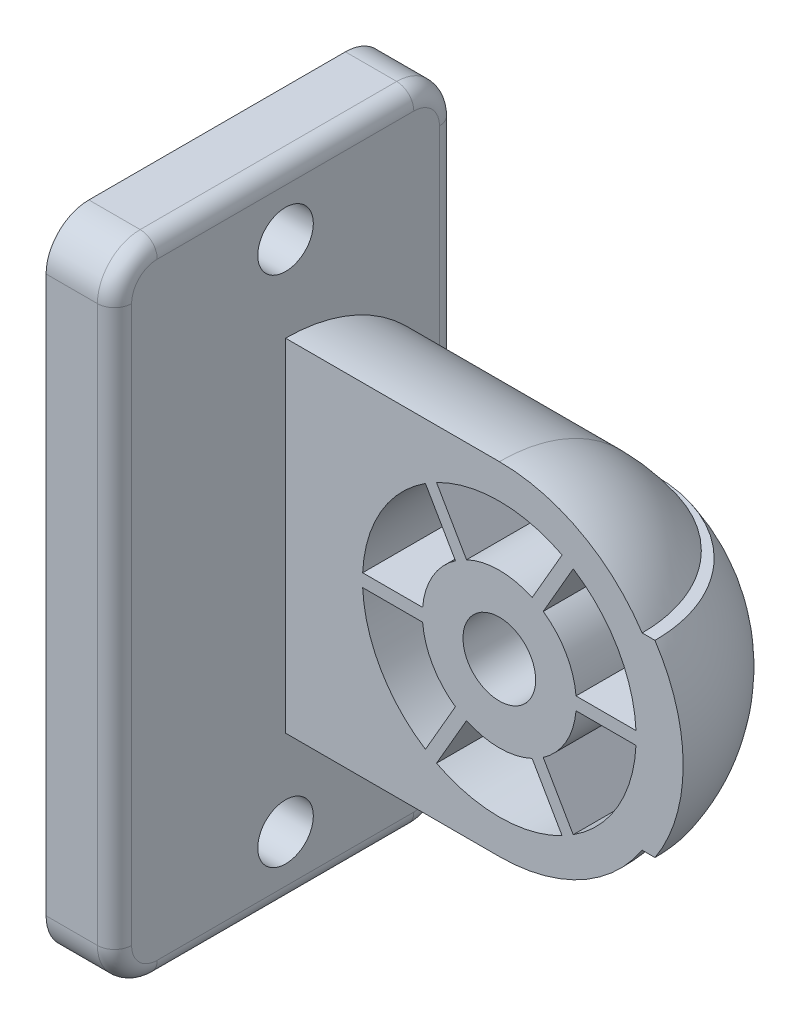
ISO-10303-21;
HEADER;
FILE_DESCRIPTION(('STEP AP214'),'2;1');
FILE_NAME('part.step','',(''),(''),'','','');
FILE_SCHEMA(('AUTOMOTIVE_DESIGN { 1 0 10303 214 1 1 1 1 }'));
ENDSEC;
DATA;
#1=APPLICATION_CONTEXT('core data for automotive mechanical design processes');
#2=APPLICATION_PROTOCOL_DEFINITION('international standard','automotive_design',2000,#1);
#3=PRODUCT_CONTEXT('',#1,'mechanical');
#4=PRODUCT('Part','Part','',(#3));
#5=PRODUCT_RELATED_PRODUCT_CATEGORY('part','',(#4));
#6=PRODUCT_DEFINITION_FORMATION('','',#4);
#7=PRODUCT_DEFINITION_CONTEXT('part definition',#1,'design');
#8=PRODUCT_DEFINITION('design','',#6,#7);
#9=PRODUCT_DEFINITION_SHAPE('','',#8);
#10=(LENGTH_UNIT() NAMED_UNIT(*) SI_UNIT(.MILLI.,.METRE.));
#11=(NAMED_UNIT(*) PLANE_ANGLE_UNIT() SI_UNIT($,.RADIAN.));
#12=(NAMED_UNIT(*) SI_UNIT($,.STERADIAN.) SOLID_ANGLE_UNIT());
#13=UNCERTAINTY_MEASURE_WITH_UNIT(LENGTH_MEASURE(1.E-05),#10,'distance_accuracy_value','');
#14=(GEOMETRIC_REPRESENTATION_CONTEXT(3) GLOBAL_UNCERTAINTY_ASSIGNED_CONTEXT((#13)) GLOBAL_UNIT_ASSIGNED_CONTEXT((#10,
#11,#12)) REPRESENTATION_CONTEXT('',''));
#15=CARTESIAN_POINT('',(0.,0.,0.));
#16=DIRECTION('',(0.,0.,1.));
#17=DIRECTION('',(1.,0.,0.));
#18=AXIS2_PLACEMENT_3D('',#15,#16,#17);
#19=CARTESIAN_POINT('',(8.00000000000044,-35.5000000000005,35.5));
#20=DIRECTION('',(1.,0.,0.));
#21=DIRECTION('',(0.,0.,-1.));
#22=AXIS2_PLACEMENT_3D('',#19,#20,#21);
#23=PLANE('',#22);
#24=CARTESIAN_POINT('',(7.99999999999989,30.,0.));
#25=DIRECTION('',(1.,0.,0.));
#26=DIRECTION('',(0.,0.,-1.));
#27=AXIS2_PLACEMENT_3D('',#24,#25,#26);
#28=CIRCLE('',#27,3.25);
#29=CARTESIAN_POINT('',(7.99999999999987,30.,-3.25));
#30=VERTEX_POINT('',#29);
#31=EDGE_CURVE('E396',#30,#30,#28,.T.);
#32=ORIENTED_EDGE('',*,*,#31,.F.);
#33=EDGE_LOOP('',(#32));
#34=FACE_BOUND('',#33,.T.);
#35=CARTESIAN_POINT('',(8.0000000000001,-30.,0.));
#36=DIRECTION('',(1.,0.,0.));
#37=DIRECTION('',(0.,0.,-1.));
#38=AXIS2_PLACEMENT_3D('',#35,#36,#37);
#39=CIRCLE('',#38,3.25);
#40=CARTESIAN_POINT('',(8.00000000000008,-30.,-3.25));
#41=VERTEX_POINT('',#40);
#42=EDGE_CURVE('E393',#41,#41,#39,.T.);
#43=ORIENTED_EDGE('',*,*,#42,.F.);
#44=EDGE_LOOP('',(#43));
#45=FACE_BOUND('',#44,.T.);
#46=DIRECTION('',(0.,1.,0.));
#47=VECTOR('',#46,1.);
#48=CARTESIAN_POINT('',(8.00000000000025,-35.5000000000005,18.));
#49=LINE('',#48,#47);
#50=CARTESIAN_POINT('',(8.,32.5,18.));
#51=VERTEX_POINT('',#50);
#52=CARTESIAN_POINT('',(8.00000000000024,-32.5,18.));
#53=VERTEX_POINT('',#52);
#54=EDGE_CURVE('E682',#51,#53,#49,.F.);
#55=ORIENTED_EDGE('',*,*,#54,.T.);
#56=CARTESIAN_POINT('',(8.00000000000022,-32.5,15.));
#57=DIRECTION('',(1.,0.,0.));
#58=DIRECTION('',(0.,0.,-1.));
#59=AXIS2_PLACEMENT_3D('',#56,#57,#58);
#60=CIRCLE('',#59,3.);
#61=CARTESIAN_POINT('',(8.00000000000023,-35.5,15.));
#62=VERTEX_POINT('',#61);
#63=EDGE_CURVE('E686',#53,#62,#60,.T.);
#64=ORIENTED_EDGE('',*,*,#63,.T.);
#65=DIRECTION('',(0.,0.,-1.));
#66=VECTOR('',#65,1.);
#67=CARTESIAN_POINT('',(8.00000000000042,-35.5,32.5000000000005));
#68=LINE('',#67,#66);
#69=CARTESIAN_POINT('',(8.,-35.5,-15.));
#70=VERTEX_POINT('',#69);
#71=EDGE_CURVE('E651',#62,#70,#68,.T.);
#72=ORIENTED_EDGE('',*,*,#71,.T.);
#73=CARTESIAN_POINT('',(8.,-32.5,-15.));
#74=DIRECTION('',(1.,0.,0.));
#75=DIRECTION('',(0.,0.,-1.));
#76=AXIS2_PLACEMENT_3D('',#73,#74,#75);
#77=CIRCLE('',#76,3.);
#78=CARTESIAN_POINT('',(8.,-32.5,-18.));
#79=VERTEX_POINT('',#78);
#80=EDGE_CURVE('E680',#70,#79,#77,.T.);
#81=ORIENTED_EDGE('',*,*,#80,.T.);
#82=DIRECTION('',(0.,-1.,0.));
#83=VECTOR('',#82,1.);
#84=CARTESIAN_POINT('',(8.,-35.5000000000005,-18.));
#85=LINE('',#84,#83);
#86=CARTESIAN_POINT('',(8.00000000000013,-8.71779788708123,-18.));
#87=VERTEX_POINT('',#86);
#88=EDGE_CURVE('E678',#79,#87,#85,.F.);
#89=ORIENTED_EDGE('',*,*,#88,.T.);
#90=CARTESIAN_POINT('',(8.00000000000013,0.,0.));
#91=DIRECTION('',(-1.,0.,0.));
#92=DIRECTION('',(0.,0.,1.));
#93=AXIS2_PLACEMENT_3D('',#90,#91,#92);
#94=CIRCLE('',#93,20.);
#95=CARTESIAN_POINT('',(8.00000000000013,-20.,0.));
#96=VERTEX_POINT('',#95);
#97=EDGE_CURVE('E647',#87,#96,#94,.T.);
#98=ORIENTED_EDGE('',*,*,#97,.T.);
#99=DIRECTION('',(0.,1.,0.));
#100=VECTOR('',#99,1.);
#101=CARTESIAN_POINT('',(8.,0.,0.));
#102=LINE('',#101,#100);
#103=CARTESIAN_POINT('',(8.,20.,1.37754248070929E-13));
#104=VERTEX_POINT('',#103);
#105=EDGE_CURVE('E634',#96,#104,#102,.T.);
#106=ORIENTED_EDGE('',*,*,#105,.T.);
#107=CARTESIAN_POINT('',(8.00000000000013,8.71779788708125,-18.));
#108=VERTEX_POINT('',#107);
#109=EDGE_CURVE('E648',#104,#108,#94,.T.);
#110=ORIENTED_EDGE('',*,*,#109,.T.);
#111=DIRECTION('',(0.,-1.,0.));
#112=VECTOR('',#111,1.);
#113=CARTESIAN_POINT('',(8.,-35.5000000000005,-18.));
#114=LINE('',#113,#112);
#115=CARTESIAN_POINT('',(7.99999999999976,32.5,-18.));
#116=VERTEX_POINT('',#115);
#117=EDGE_CURVE('E671',#108,#116,#114,.F.);
#118=ORIENTED_EDGE('',*,*,#117,.T.);
#119=CARTESIAN_POINT('',(7.99999999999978,32.5,-15.));
#120=DIRECTION('',(1.,0.,0.));
#121=DIRECTION('',(0.,0.,-1.));
#122=AXIS2_PLACEMENT_3D('',#119,#120,#121);
#123=CIRCLE('',#122,3.);
#124=CARTESIAN_POINT('',(7.99999999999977,35.5,-15.));
#125=VERTEX_POINT('',#124);
#126=EDGE_CURVE('E676',#116,#125,#123,.T.);
#127=ORIENTED_EDGE('',*,*,#126,.T.);
#128=DIRECTION('',(0.,0.,1.));
#129=VECTOR('',#128,1.);
#130=CARTESIAN_POINT('',(7.99999999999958,35.5,-32.5000000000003));
#131=LINE('',#130,#129);
#132=CARTESIAN_POINT('',(8.,35.5,15.));
#133=VERTEX_POINT('',#132);
#134=EDGE_CURVE('E662',#125,#133,#131,.T.);
#135=ORIENTED_EDGE('',*,*,#134,.T.);
#136=CARTESIAN_POINT('',(8.,32.5,15.));
#137=DIRECTION('',(1.,0.,0.));
#138=DIRECTION('',(0.,0.,-1.));
#139=AXIS2_PLACEMENT_3D('',#136,#137,#138);
#140=CIRCLE('',#139,3.);
#141=EDGE_CURVE('E684',#133,#51,#140,.T.);
#142=ORIENTED_EDGE('',*,*,#141,.T.);
#143=EDGE_LOOP('',(#55,#64,#72,#81,#89,#98,#106,#110,#118,#127,#135,#142));
#144=FACE_BOUND('',#143,.T.);
#145=ADVANCED_FACE('F14',(#34,#45,#144),#23,.T.);
#146=CARTESIAN_POINT('',(0.500000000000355,-37.5,32.5));
#147=DIRECTION('',(0.,-1.,0.));
#148=DIRECTION('',(0.,0.,-1.));
#149=AXIS2_PLACEMENT_3D('',#146,#147,#148);
#150=PLANE('',#149);
#151=DIRECTION('',(0.,0.,1.));
#152=VECTOR('',#151,1.);
#153=CARTESIAN_POINT('',(5.99999999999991,-37.5,-32.5));
#154=LINE('',#153,#152);
#155=CARTESIAN_POINT('',(6.,-37.5,-15.));
#156=VERTEX_POINT('',#155);
#157=CARTESIAN_POINT('',(6.00000000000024,-37.5,15.));
#158=VERTEX_POINT('',#157);
#159=EDGE_CURVE('E674',#156,#158,#154,.T.);
#160=ORIENTED_EDGE('',*,*,#159,.T.);
#161=DIRECTION('',(1.,0.,0.));
#162=VECTOR('',#161,1.);
#163=CARTESIAN_POINT('',(0.50000000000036,-37.5,15.));
#164=LINE('',#163,#162);
#165=CARTESIAN_POINT('',(2.34187669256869E-13,-37.5,15.));
#166=VERTEX_POINT('',#165);
#167=EDGE_CURVE('E355',#158,#166,#164,.F.);
#168=ORIENTED_EDGE('',*,*,#167,.T.);
#169=DIRECTION('',(0.,0.,1.));
#170=VECTOR('',#169,1.);
#171=CARTESIAN_POINT('',(0.,-37.5,-15.));
#172=LINE('',#171,#170);
#173=CARTESIAN_POINT('',(0.,-37.5,-15.));
#174=VERTEX_POINT('',#173);
#175=EDGE_CURVE('E359',#174,#166,#172,.T.);
#176=ORIENTED_EDGE('',*,*,#175,.F.);
#177=DIRECTION('',(-1.,0.,0.));
#178=VECTOR('',#177,1.);
#179=CARTESIAN_POINT('',(0.500000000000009,-37.5,-15.));
#180=LINE('',#179,#178);
#181=EDGE_CURVE('E344',#174,#156,#180,.F.);
#182=ORIENTED_EDGE('',*,*,#181,.T.);
#183=EDGE_LOOP('',(#160,#168,#176,#182));
#184=FACE_BOUND('',#183,.T.);
#185=ADVANCED_FACE('F360',(#184),#150,.T.);
#186=CARTESIAN_POINT('',(0.499999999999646,37.5,-32.5));
#187=DIRECTION('',(0.,1.,0.));
#188=DIRECTION('',(0.,0.,1.));
#189=AXIS2_PLACEMENT_3D('',#186,#187,#188);
#190=PLANE('',#189);
#191=DIRECTION('',(1.,0.,0.));
#192=VECTOR('',#191,1.);
#193=CARTESIAN_POINT('',(0.49999999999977,37.5,-15.));
#194=LINE('',#193,#192);
#195=CARTESIAN_POINT('',(5.99999999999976,37.5,-15.));
#196=VERTEX_POINT('',#195);
#197=CARTESIAN_POINT('',(-2.37657116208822E-13,37.5,-15.));
#198=VERTEX_POINT('',#197);
#199=EDGE_CURVE('E836',#196,#198,#194,.F.);
#200=ORIENTED_EDGE('',*,*,#199,.T.);
#201=DIRECTION('',(0.,0.,-1.));
#202=VECTOR('',#201,1.);
#203=CARTESIAN_POINT('',(0.,37.5,15.));
#204=LINE('',#203,#202);
#205=CARTESIAN_POINT('',(0.,37.5,15.));
#206=VERTEX_POINT('',#205);
#207=EDGE_CURVE('E387',#206,#198,#204,.T.);
#208=ORIENTED_EDGE('',*,*,#207,.F.);
#209=DIRECTION('',(-1.,0.,0.));
#210=VECTOR('',#209,1.);
#211=CARTESIAN_POINT('',(0.499999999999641,37.5,15.));
#212=LINE('',#211,#210);
#213=CARTESIAN_POINT('',(6.,37.5,15.));
#214=VERTEX_POINT('',#213);
#215=EDGE_CURVE('E838',#206,#214,#212,.F.);
#216=ORIENTED_EDGE('',*,*,#215,.T.);
#217=DIRECTION('',(0.,0.,-1.));
#218=VECTOR('',#217,1.);
#219=CARTESIAN_POINT('',(6.0000000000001,37.5,32.5));
#220=LINE('',#219,#218);
#221=EDGE_CURVE('E833',#214,#196,#220,.T.);
#222=ORIENTED_EDGE('',*,*,#221,.T.);
#223=EDGE_LOOP('',(#200,#208,#216,#222));
#224=FACE_BOUND('',#223,.T.);
#225=ADVANCED_FACE('F816',(#224),#190,.T.);
#226=CARTESIAN_POINT('',(6.00000000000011,35.5,32.5000000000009));
#227=DIRECTION('',(0.,0.,1.));
#228=DIRECTION('',(1.,0.,0.));
#229=AXIS2_PLACEMENT_3D('',#226,#227,#228);
#230=CYLINDRICAL_SURFACE('',#229,2.);
#231=ORIENTED_EDGE('',*,*,#221,.F.);
#232=CARTESIAN_POINT('',(6.,35.5,15.));
#233=DIRECTION('',(0.,0.,1.));
#234=DIRECTION('',(1.,0.,0.));
#235=AXIS2_PLACEMENT_3D('',#232,#233,#234);
#236=CIRCLE('',#235,2.);
#237=EDGE_CURVE('E693',#214,#133,#236,.F.);
#238=ORIENTED_EDGE('',*,*,#237,.T.);
#239=ORIENTED_EDGE('',*,*,#134,.F.);
#240=CARTESIAN_POINT('',(5.99999999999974,35.5,-15.));
#241=DIRECTION('',(0.,0.,1.));
#242=DIRECTION('',(1.,0.,0.));
#243=AXIS2_PLACEMENT_3D('',#240,#241,#242);
#244=CIRCLE('',#243,2.);
#245=EDGE_CURVE('E690',#125,#196,#244,.T.);
#246=ORIENTED_EDGE('',*,*,#245,.T.);
#247=EDGE_LOOP('',(#231,#238,#239,#246));
#248=FACE_BOUND('',#247,.T.);
#249=ADVANCED_FACE('F1528',(#248),#230,.T.);
#250=CARTESIAN_POINT('',(6.00000000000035,-35.5,32.5000000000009));
#251=DIRECTION('',(0.,0.,-1.));
#252=DIRECTION('',(1.,0.,0.));
#253=AXIS2_PLACEMENT_3D('',#250,#251,#252);
#254=CYLINDRICAL_SURFACE('',#253,2.);
#255=ORIENTED_EDGE('',*,*,#71,.F.);
#256=CARTESIAN_POINT('',(6.00000000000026,-35.5,15.));
#257=DIRECTION('',(0.,0.,-1.));
#258=DIRECTION('',(-1.,0.,0.));
#259=AXIS2_PLACEMENT_3D('',#256,#257,#258);
#260=CIRCLE('',#259,2.);
#261=EDGE_CURVE('E668',#62,#158,#260,.T.);
#262=ORIENTED_EDGE('',*,*,#261,.T.);
#263=ORIENTED_EDGE('',*,*,#159,.F.);
#264=CARTESIAN_POINT('',(6.,-35.5,-15.));
#265=DIRECTION('',(0.,0.,-1.));
#266=DIRECTION('',(-1.,0.,0.));
#267=AXIS2_PLACEMENT_3D('',#264,#265,#266);
#268=CIRCLE('',#267,2.);
#269=EDGE_CURVE('E665',#156,#70,#268,.F.);
#270=ORIENTED_EDGE('',*,*,#269,.T.);
#271=EDGE_LOOP('',(#255,#262,#263,#270));
#272=FACE_BOUND('',#271,.T.);
#273=ADVANCED_FACE('F787',(#272),#254,.T.);
#274=CARTESIAN_POINT('',(54.5,0.,0.));
#275=DIRECTION('',(-1.,0.,0.));
#276=DIRECTION('',(0.,0.,1.));
#277=AXIS2_PLACEMENT_3D('',#274,#275,#276);
#278=CYLINDRICAL_SURFACE('',#277,20.);
#279=DIRECTION('',(-1.,0.,0.));
#280=VECTOR('',#279,1.);
#281=CARTESIAN_POINT('',(54.4999999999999,6.75,-18.8265105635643));
#282=LINE('',#281,#280);
#283=CARTESIAN_POINT('',(29.1028856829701,6.75,-18.8265105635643));
#284=VERTEX_POINT('',#283);
#285=CARTESIAN_POINT('',(34.4999999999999,6.75,-18.8265105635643));
#286=VERTEX_POINT('',#285);
#287=EDGE_CURVE('E626',#284,#286,#282,.F.);
#288=ORIENTED_EDGE('',*,*,#287,.F.);
#289=CARTESIAN_POINT('',(25.20577136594,0.,0.));
#290=DIRECTION('',(-0.866025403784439,0.5,0.));
#291=DIRECTION('',(-0.5,-0.866025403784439,0.));
#292=AXIS2_PLACEMENT_3D('',#289,#290,#291);
#293=ELLIPSE('',#292,23.0940107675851,20.);
#294=CARTESIAN_POINT('',(25.20577136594,0.,-20.));
#295=VERTEX_POINT('',#294);
#296=EDGE_CURVE('E889',#295,#284,#293,.F.);
#297=ORIENTED_EDGE('',*,*,#296,.F.);
#298=CARTESIAN_POINT('',(25.20577136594,0.,0.));
#299=DIRECTION('',(-0.866025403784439,-0.5,0.));
#300=DIRECTION('',(-0.5,0.866025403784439,0.));
#301=AXIS2_PLACEMENT_3D('',#298,#299,#300);
#302=ELLIPSE('',#301,23.0940107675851,20.);
#303=CARTESIAN_POINT('',(29.1028856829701,-6.75,-18.8265105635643));
#304=VERTEX_POINT('',#303);
#305=EDGE_CURVE('E887',#304,#295,#302,.F.);
#306=ORIENTED_EDGE('',*,*,#305,.F.);
#307=DIRECTION('',(-1.,0.,0.));
#308=VECTOR('',#307,1.);
#309=CARTESIAN_POINT('',(54.5,-6.75,-18.8265105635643));
#310=LINE('',#309,#308);
#311=CARTESIAN_POINT('',(34.5,-6.75,-18.8265105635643));
#312=VERTEX_POINT('',#311);
#313=EDGE_CURVE('E624',#312,#304,#310,.T.);
#314=ORIENTED_EDGE('',*,*,#313,.F.);
#315=CARTESIAN_POINT('',(34.5,0.,0.));
#316=DIRECTION('',(-1.,0.,0.));
#317=DIRECTION('',(0.,0.,1.));
#318=AXIS2_PLACEMENT_3D('',#315,#316,#317);
#319=CIRCLE('',#318,20.);
#320=CARTESIAN_POINT('',(34.5,-11.,-16.7032930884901));
#321=VERTEX_POINT('',#320);
#322=EDGE_CURVE('E866',#312,#321,#319,.T.);
#323=ORIENTED_EDGE('',*,*,#322,.T.);
#324=DIRECTION('',(-1.,0.,0.));
#325=VECTOR('',#324,1.);
#326=CARTESIAN_POINT('',(54.5,-11.,-16.7032930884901));
#327=LINE('',#326,#325);
#328=CARTESIAN_POINT('',(33.,-11.,-16.7032930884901));
#329=VERTEX_POINT('',#328);
#330=EDGE_CURVE('E849',#329,#321,#327,.F.);
#331=ORIENTED_EDGE('',*,*,#330,.F.);
#332=CARTESIAN_POINT('',(33.,0.,0.));
#333=DIRECTION('',(-1.,0.,0.));
#334=DIRECTION('',(0.,0.,1.));
#335=AXIS2_PLACEMENT_3D('',#332,#333,#334);
#336=CIRCLE('',#335,20.);
#337=CARTESIAN_POINT('',(33.,-20.,0.));
#338=VERTEX_POINT('',#337);
#339=EDGE_CURVE('E643',#329,#338,#336,.T.);
#340=ORIENTED_EDGE('',*,*,#339,.T.);
#341=DIRECTION('',(1.,0.,0.));
#342=VECTOR('',#341,1.);
#343=CARTESIAN_POINT('',(8.00000000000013,-20.,0.));
#344=LINE('',#343,#342);
#345=EDGE_CURVE('E631',#96,#338,#344,.T.);
#346=ORIENTED_EDGE('',*,*,#345,.F.);
#347=ORIENTED_EDGE('',*,*,#97,.F.);
#348=CARTESIAN_POINT('',(7.99999999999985,0.,-20.));
#349=VERTEX_POINT('',#348);
#350=EDGE_CURVE('E653',#349,#87,#94,.T.);
#351=ORIENTED_EDGE('',*,*,#350,.F.);
#352=EDGE_CURVE('E652',#108,#349,#94,.T.);
#353=ORIENTED_EDGE('',*,*,#352,.F.);
#354=ORIENTED_EDGE('',*,*,#109,.F.);
#355=DIRECTION('',(1.,0.,0.));
#356=VECTOR('',#355,1.);
#357=CARTESIAN_POINT('',(8.00000000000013,20.,1.39659253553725E-13));
#358=LINE('',#357,#356);
#359=CARTESIAN_POINT('',(33.,20.,1.39659253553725E-13));
#360=VERTEX_POINT('',#359);
#361=EDGE_CURVE('E637',#104,#360,#358,.T.);
#362=ORIENTED_EDGE('',*,*,#361,.T.);
#363=CARTESIAN_POINT('',(33.,11.,-16.70329308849));
#364=VERTEX_POINT('',#363);
#365=EDGE_CURVE('E644',#360,#364,#336,.T.);
#366=ORIENTED_EDGE('',*,*,#365,.T.);
#367=DIRECTION('',(-1.,0.,0.));
#368=VECTOR('',#367,1.);
#369=CARTESIAN_POINT('',(54.5,11.,-16.7032930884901));
#370=LINE('',#369,#368);
#371=CARTESIAN_POINT('',(34.5,11.,-16.7032930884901));
#372=VERTEX_POINT('',#371);
#373=EDGE_CURVE('E857',#372,#364,#370,.T.);
#374=ORIENTED_EDGE('',*,*,#373,.F.);
#375=EDGE_CURVE('E867',#372,#286,#319,.T.);
#376=ORIENTED_EDGE('',*,*,#375,.T.);
#377=EDGE_LOOP('',(#288,#297,#306,#314,#323,#331,#340,#346,#347,#351,#353,#354,#362,#366,#374,#376));
#378=FACE_BOUND('',#377,.T.);
#379=ADVANCED_FACE('F781',(#378),#278,.T.);
#380=CARTESIAN_POINT('',(34.5,0.,0.));
#381=DIRECTION('',(-1.,0.,0.));
#382=DIRECTION('',(0.,1.,0.));
#383=AXIS2_PLACEMENT_3D('',#380,#381,#382);
#384=SPHERICAL_SURFACE('',#383,20.);
#385=CARTESIAN_POINT('',(34.5,6.75,0.));
#386=DIRECTION('',(0.,1.,0.));
#387=DIRECTION('',(0.,0.,1.));
#388=AXIS2_PLACEMENT_3D('',#385,#386,#387);
#389=CIRCLE('',#388,18.8265105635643);
#390=CARTESIAN_POINT('',(36.8971143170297,6.75,-18.6732788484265));
#391=VERTEX_POINT('',#390);
#392=EDGE_CURVE('E885',#286,#391,#389,.F.);
#393=ORIENTED_EDGE('',*,*,#392,.F.);
#394=ORIENTED_EDGE('',*,*,#375,.F.);
#395=CARTESIAN_POINT('',(34.5,11.,0.));
#396=DIRECTION('',(0.,-1.,0.));
#397=DIRECTION('',(0.,0.,-1.));
#398=AXIS2_PLACEMENT_3D('',#395,#396,#397);
#399=CIRCLE('',#398,16.7032930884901);
#400=CARTESIAN_POINT('',(51.2032930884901,11.,0.));
#401=VERTEX_POINT('',#400);
#402=EDGE_CURVE('E855',#401,#372,#399,.F.);
#403=ORIENTED_EDGE('',*,*,#402,.F.);
#404=CARTESIAN_POINT('',(34.5,0.,0.));
#405=DIRECTION('',(0.,0.,-1.));
#406=DIRECTION('',(1.,0.,0.));
#407=AXIS2_PLACEMENT_3D('',#404,#405,#406);
#408=CIRCLE('',#407,20.);
#409=CARTESIAN_POINT('',(51.2032930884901,-11.,0.));
#410=VERTEX_POINT('',#409);
#411=EDGE_CURVE('E863',#401,#410,#408,.T.);
#412=ORIENTED_EDGE('',*,*,#411,.T.);
#413=CARTESIAN_POINT('',(34.5,-11.,0.));
#414=DIRECTION('',(0.,1.,0.));
#415=DIRECTION('',(0.,0.,1.));
#416=AXIS2_PLACEMENT_3D('',#413,#414,#415);
#417=CIRCLE('',#416,16.70329308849);
#418=EDGE_CURVE('E843',#321,#410,#417,.F.);
#419=ORIENTED_EDGE('',*,*,#418,.F.);
#420=ORIENTED_EDGE('',*,*,#322,.F.);
#421=CARTESIAN_POINT('',(34.5,-6.75,0.));
#422=DIRECTION('',(0.,-1.,0.));
#423=DIRECTION('',(1.,0.,0.));
#424=AXIS2_PLACEMENT_3D('',#421,#422,#423);
#425=CIRCLE('',#424,18.8265105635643);
#426=CARTESIAN_POINT('',(36.89711431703,-6.75,-18.6732788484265));
#427=VERTEX_POINT('',#426);
#428=EDGE_CURVE('E876',#427,#312,#425,.F.);
#429=ORIENTED_EDGE('',*,*,#428,.F.);
#430=CARTESIAN_POINT('',(39.2206714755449,-2.72548094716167,0.));
#431=DIRECTION('',(0.866025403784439,-0.5,0.));
#432=DIRECTION('',(0.5,0.866025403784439,0.));
#433=AXIS2_PLACEMENT_3D('',#430,#431,#432);
#434=CIRCLE('',#433,19.242843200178);
#435=CARTESIAN_POINT('',(40.79422863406,0.,-18.9837479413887));
#436=VERTEX_POINT('',#435);
#437=EDGE_CURVE('E880',#436,#427,#434,.F.);
#438=ORIENTED_EDGE('',*,*,#437,.F.);
#439=CARTESIAN_POINT('',(39.2206714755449,2.72548094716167,0.));
#440=DIRECTION('',(0.866025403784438,0.5,0.));
#441=DIRECTION('',(-0.5,0.866025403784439,0.));
#442=AXIS2_PLACEMENT_3D('',#439,#440,#441);
#443=CIRCLE('',#442,19.242843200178);
#444=EDGE_CURVE('E883',#391,#436,#443,.F.);
#445=ORIENTED_EDGE('',*,*,#444,.F.);
#446=EDGE_LOOP('',(#393,#394,#403,#412,#419,#420,#429,#438,#445));
#447=FACE_BOUND('',#446,.T.);
#448=ADVANCED_FACE('F786',(#447),#384,.T.);
#449=CARTESIAN_POINT('',(33.,0.,0.));
#450=DIRECTION('',(0.,0.,-1.));
#451=DIRECTION('',(1.,0.,0.));
#452=AXIS2_PLACEMENT_3D('',#449,#450,#451);
#453=PLANE('',#452);
#454=DIRECTION('',(1.,0.,0.));
#455=VECTOR('',#454,1.);
#456=CARTESIAN_POINT('',(24.031304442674,0.749999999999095,0.));
#457=LINE('',#456,#455);
#458=CARTESIAN_POINT('',(17.0175877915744,0.749999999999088,0.));
#459=VERTEX_POINT('',#458);
#460=CARTESIAN_POINT('',(24.031304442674,0.749999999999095,0.));
#461=VERTEX_POINT('',#460);
#462=EDGE_CURVE('E483',#459,#461,#457,.T.);
#463=ORIENTED_EDGE('',*,*,#462,.F.);
#464=CARTESIAN_POINT('',(33.,0.,0.));
#465=DIRECTION('',(0.,0.,1.));
#466=DIRECTION('',(1.,0.,0.));
#467=AXIS2_PLACEMENT_3D('',#464,#465,#466);
#468=CIRCLE('',#467,16.0000000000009);
#469=CARTESIAN_POINT('',(24.3592748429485,13.4661749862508,0.));
#470=VERTEX_POINT('',#469);
#471=EDGE_CURVE('E427',#470,#459,#468,.T.);
#472=ORIENTED_EDGE('',*,*,#471,.F.);
#473=DIRECTION('',(-0.5,0.866025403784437,0.));
#474=VECTOR('',#473,1.);
#475=CARTESIAN_POINT('',(27.8661331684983,7.39211819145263,0.));
#476=LINE('',#475,#474);
#477=CARTESIAN_POINT('',(27.8661331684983,7.39211819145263,0.));
#478=VERTEX_POINT('',#477);
#479=EDGE_CURVE('E472',#478,#470,#476,.T.);
#480=ORIENTED_EDGE('',*,*,#479,.F.);
#481=CARTESIAN_POINT('',(33.,0.,0.));
#482=DIRECTION('',(0.,0.,-1.));
#483=DIRECTION('',(1.,0.,0.));
#484=AXIS2_PLACEMENT_3D('',#481,#482,#483);
#485=CIRCLE('',#484,8.99999999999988);
#486=EDGE_CURVE('E486',#461,#478,#485,.T.);
#487=ORIENTED_EDGE('',*,*,#486,.F.);
#488=EDGE_LOOP('',(#463,#472,#480,#487));
#489=FACE_BOUND('',#488,.T.);
#490=DIRECTION('',(0.5,0.866025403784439,0.));
#491=VECTOR('',#490,1.);
#492=CARTESIAN_POINT('',(27.8661331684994,-7.3921181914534,0.));
#493=LINE('',#492,#491);
#494=CARTESIAN_POINT('',(24.3592748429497,-13.4661749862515,0.));
#495=VERTEX_POINT('',#494);
#496=CARTESIAN_POINT('',(27.8661331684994,-7.3921181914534,0.));
#497=VERTEX_POINT('',#496);
#498=EDGE_CURVE('E450',#495,#497,#493,.T.);
#499=ORIENTED_EDGE('',*,*,#498,.F.);
#500=CARTESIAN_POINT('',(33.,0.,0.));
#501=DIRECTION('',(0.,0.,1.));
#502=DIRECTION('',(1.,0.,0.));
#503=AXIS2_PLACEMENT_3D('',#500,#501,#502);
#504=CIRCLE('',#503,16.0000000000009);
#505=CARTESIAN_POINT('',(17.0175877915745,-0.750000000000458,0.));
#506=VERTEX_POINT('',#505);
#507=EDGE_CURVE('E448',#506,#495,#504,.T.);
#508=ORIENTED_EDGE('',*,*,#507,.F.);
#509=DIRECTION('',(-1.,0.,0.));
#510=VECTOR('',#509,1.);
#511=CARTESIAN_POINT('',(24.0313044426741,-0.750000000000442,0.));
#512=LINE('',#511,#510);
#513=CARTESIAN_POINT('',(24.0313044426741,-0.750000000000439,0.));
#514=VERTEX_POINT('',#513);
#515=EDGE_CURVE('E438',#514,#506,#512,.T.);
#516=ORIENTED_EDGE('',*,*,#515,.F.);
#517=CARTESIAN_POINT('',(33.,0.,0.));
#518=DIRECTION('',(0.,0.,-1.));
#519=DIRECTION('',(1.,0.,0.));
#520=AXIS2_PLACEMENT_3D('',#517,#518,#519);
#521=CIRCLE('',#520,8.99999999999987);
#522=EDGE_CURVE('E454',#497,#514,#521,.T.);
#523=ORIENTED_EDGE('',*,*,#522,.F.);
#524=EDGE_LOOP('',(#499,#508,#516,#523));
#525=FACE_BOUND('',#524,.T.);
#526=DIRECTION('',(-1.,0.,0.));
#527=VECTOR('',#526,1.);
#528=CARTESIAN_POINT('',(41.968695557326,-0.749999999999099,0.));
#529=LINE('',#528,#527);
#530=CARTESIAN_POINT('',(48.9824122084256,-0.749999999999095,0.));
#531=VERTEX_POINT('',#530);
#532=CARTESIAN_POINT('',(41.968695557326,-0.749999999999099,0.));
#533=VERTEX_POINT('',#532);
#534=EDGE_CURVE('E545',#531,#533,#529,.T.);
#535=ORIENTED_EDGE('',*,*,#534,.F.);
#536=CARTESIAN_POINT('',(33.,0.,0.));
#537=DIRECTION('',(0.,0.,1.));
#538=DIRECTION('',(1.,0.,0.));
#539=AXIS2_PLACEMENT_3D('',#536,#537,#538);
#540=CIRCLE('',#539,16.000000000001);
#541=CARTESIAN_POINT('',(41.6407251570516,-13.4661749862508,0.));
#542=VERTEX_POINT('',#541);
#543=EDGE_CURVE('E523',#542,#531,#540,.T.);
#544=ORIENTED_EDGE('',*,*,#543,.F.);
#545=DIRECTION('',(0.500000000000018,-0.866025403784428,0.));
#546=VECTOR('',#545,1.);
#547=CARTESIAN_POINT('',(38.1338668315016,-7.39211819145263,0.));
#548=LINE('',#547,#546);
#549=CARTESIAN_POINT('',(38.1338668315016,-7.39211819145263,0.));
#550=VERTEX_POINT('',#549);
#551=EDGE_CURVE('E534',#550,#542,#548,.T.);
#552=ORIENTED_EDGE('',*,*,#551,.F.);
#553=CARTESIAN_POINT('',(33.,0.,0.));
#554=DIRECTION('',(0.,0.,-1.));
#555=DIRECTION('',(1.,0.,0.));
#556=AXIS2_PLACEMENT_3D('',#553,#554,#555);
#557=CIRCLE('',#556,8.99999999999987);
#558=EDGE_CURVE('E548',#533,#550,#557,.T.);
#559=ORIENTED_EDGE('',*,*,#558,.F.);
#560=EDGE_LOOP('',(#535,#544,#552,#559));
#561=FACE_BOUND('',#560,.T.);
#562=DIRECTION('',(-0.5,0.866025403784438,0.));
#563=VECTOR('',#562,1.);
#564=CARTESIAN_POINT('',(36.8348287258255,-8.1421181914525,0.));
#565=LINE('',#564,#563);
#566=CARTESIAN_POINT('',(40.3416870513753,-14.2161749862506,0.));
#567=VERTEX_POINT('',#566);
#568=CARTESIAN_POINT('',(36.8348287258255,-8.1421181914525,0.));
#569=VERTEX_POINT('',#568);
#570=EDGE_CURVE('E513',#567,#569,#565,.T.);
#571=ORIENTED_EDGE('',*,*,#570,.F.);
#572=CARTESIAN_POINT('',(33.,0.,0.));
#573=DIRECTION('',(0.,0.,1.));
#574=DIRECTION('',(1.,0.,0.));
#575=AXIS2_PLACEMENT_3D('',#572,#573,#574);
#576=CIRCLE('',#575,16.0000000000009);
#577=CARTESIAN_POINT('',(25.658312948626,-14.2161749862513,0.));
#578=VERTEX_POINT('',#577);
#579=EDGE_CURVE('E461',#578,#567,#576,.T.);
#580=ORIENTED_EDGE('',*,*,#579,.F.);
#581=DIRECTION('',(-0.5,-0.86602540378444,0.));
#582=VECTOR('',#581,1.);
#583=CARTESIAN_POINT('',(29.1651712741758,-8.14211819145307,0.));
#584=LINE('',#583,#582);
#585=CARTESIAN_POINT('',(29.1651712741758,-8.14211819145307,0.));
#586=VERTEX_POINT('',#585);
#587=EDGE_CURVE('E502',#586,#578,#584,.T.);
#588=ORIENTED_EDGE('',*,*,#587,.F.);
#589=CARTESIAN_POINT('',(33.,0.,0.));
#590=DIRECTION('',(0.,0.,-1.));
#591=DIRECTION('',(1.,0.,0.));
#592=AXIS2_PLACEMENT_3D('',#589,#590,#591);
#593=CIRCLE('',#592,8.99999999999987);
#594=EDGE_CURVE('E516',#569,#586,#593,.T.);
#595=ORIENTED_EDGE('',*,*,#594,.F.);
#596=EDGE_LOOP('',(#571,#580,#588,#595));
#597=FACE_BOUND('',#596,.T.);
#598=DIRECTION('',(0.5,-0.866025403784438,0.));
#599=VECTOR('',#598,1.);
#600=CARTESIAN_POINT('',(29.1651712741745,8.14211819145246,0.));
#601=LINE('',#600,#599);
#602=CARTESIAN_POINT('',(25.6583129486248,14.2161749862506,0.));
#603=VERTEX_POINT('',#602);
#604=CARTESIAN_POINT('',(29.1651712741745,8.14211819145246,0.));
#605=VERTEX_POINT('',#604);
#606=EDGE_CURVE('E416',#603,#605,#601,.T.);
#607=ORIENTED_EDGE('',*,*,#606,.F.);
#608=CARTESIAN_POINT('',(33.,0.,0.));
#609=DIRECTION('',(0.,0.,1.));
#610=DIRECTION('',(1.,0.,0.));
#611=AXIS2_PLACEMENT_3D('',#608,#609,#610);
#612=CIRCLE('',#611,16.0000000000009);
#613=CARTESIAN_POINT('',(40.341687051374,14.2161749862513,0.));
#614=VERTEX_POINT('',#613);
#615=EDGE_CURVE('E414',#614,#603,#612,.T.);
#616=ORIENTED_EDGE('',*,*,#615,.F.);
#617=DIRECTION('',(0.5,0.86602540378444,0.));
#618=VECTOR('',#617,1.);
#619=CARTESIAN_POINT('',(36.8348287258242,8.14211819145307,0.));
#620=LINE('',#619,#618);
#621=CARTESIAN_POINT('',(36.8348287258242,8.14211819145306,0.));
#622=VERTEX_POINT('',#621);
#623=EDGE_CURVE('E404',#622,#614,#620,.T.);
#624=ORIENTED_EDGE('',*,*,#623,.F.);
#625=CARTESIAN_POINT('',(33.,0.,0.));
#626=DIRECTION('',(0.,0.,-1.));
#627=DIRECTION('',(1.,0.,0.));
#628=AXIS2_PLACEMENT_3D('',#625,#626,#627);
#629=CIRCLE('',#628,8.99999999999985);
#630=EDGE_CURVE('E420',#605,#622,#629,.T.);
#631=ORIENTED_EDGE('',*,*,#630,.F.);
#632=EDGE_LOOP('',(#607,#616,#624,#631));
#633=FACE_BOUND('',#632,.T.);
#634=DIRECTION('',(-0.5,-0.866025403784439,0.));
#635=VECTOR('',#634,1.);
#636=CARTESIAN_POINT('',(38.1338668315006,7.3921181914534,0.));
#637=LINE('',#636,#635);
#638=CARTESIAN_POINT('',(41.6407251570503,13.4661749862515,0.));
#639=VERTEX_POINT('',#638);
#640=CARTESIAN_POINT('',(38.1338668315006,7.3921181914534,0.));
#641=VERTEX_POINT('',#640);
#642=EDGE_CURVE('E577',#639,#641,#637,.T.);
#643=ORIENTED_EDGE('',*,*,#642,.F.);
#644=CARTESIAN_POINT('',(33.,0.,0.));
#645=DIRECTION('',(0.,0.,1.));
#646=DIRECTION('',(1.,0.,0.));
#647=AXIS2_PLACEMENT_3D('',#644,#645,#646);
#648=CIRCLE('',#647,16.0000000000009);
#649=CARTESIAN_POINT('',(48.9824122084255,0.750000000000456,0.));
#650=VERTEX_POINT('',#649);
#651=EDGE_CURVE('E555',#650,#639,#648,.T.);
#652=ORIENTED_EDGE('',*,*,#651,.F.);
#653=DIRECTION('',(1.,0.,0.));
#654=VECTOR('',#653,1.);
#655=CARTESIAN_POINT('',(41.9686955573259,0.750000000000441,0.));
#656=LINE('',#655,#654);
#657=CARTESIAN_POINT('',(41.9686955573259,0.750000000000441,0.));
#658=VERTEX_POINT('',#657);
#659=EDGE_CURVE('E566',#658,#650,#656,.T.);
#660=ORIENTED_EDGE('',*,*,#659,.F.);
#661=CARTESIAN_POINT('',(33.,0.,0.));
#662=DIRECTION('',(0.,0.,-1.));
#663=DIRECTION('',(1.,0.,0.));
#664=AXIS2_PLACEMENT_3D('',#661,#662,#663);
#665=CIRCLE('',#664,8.99999999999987);
#666=EDGE_CURVE('E580',#641,#658,#665,.T.);
#667=ORIENTED_EDGE('',*,*,#666,.F.);
#668=EDGE_LOOP('',(#643,#652,#660,#667));
#669=FACE_BOUND('',#668,.T.);
#670=CARTESIAN_POINT('',(33.,0.,0.));
#671=DIRECTION('',(0.,0.,1.));
#672=DIRECTION('',(1.,0.,0.));
#673=AXIS2_PLACEMENT_3D('',#670,#671,#672);
#674=CIRCLE('',#673,4.25);
#675=CARTESIAN_POINT('',(37.25,0.,0.));
#676=VERTEX_POINT('',#675);
#677=EDGE_CURVE('E628',#676,#676,#674,.T.);
#678=ORIENTED_EDGE('',*,*,#677,.F.);
#679=EDGE_LOOP('',(#678));
#680=FACE_BOUND('',#679,.T.);
#681=ORIENTED_EDGE('',*,*,#411,.F.);
#682=DIRECTION('',(-1.,0.,0.));
#683=VECTOR('',#682,1.);
#684=CARTESIAN_POINT('',(33.,11.,0.));
#685=LINE('',#684,#683);
#686=CARTESIAN_POINT('',(49.7032930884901,11.,0.));
#687=VERTEX_POINT('',#686);
#688=EDGE_CURVE('E873',#401,#687,#685,.T.);
#689=ORIENTED_EDGE('',*,*,#688,.T.);
#690=CARTESIAN_POINT('',(33.,0.,0.));
#691=DIRECTION('',(0.,0.,-1.));
#692=DIRECTION('',(1.,0.,0.));
#693=AXIS2_PLACEMENT_3D('',#690,#691,#692);
#694=CIRCLE('',#693,20.);
#695=EDGE_CURVE('E641',#360,#687,#694,.T.);
#696=ORIENTED_EDGE('',*,*,#695,.F.);
#697=ORIENTED_EDGE('',*,*,#361,.F.);
#698=ORIENTED_EDGE('',*,*,#105,.F.);
#699=ORIENTED_EDGE('',*,*,#345,.T.);
#700=CARTESIAN_POINT('',(49.7032930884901,-11.,0.));
#701=VERTEX_POINT('',#700);
#702=EDGE_CURVE('E640',#701,#338,#694,.T.);
#703=ORIENTED_EDGE('',*,*,#702,.F.);
#704=DIRECTION('',(1.,0.,0.));
#705=VECTOR('',#704,1.);
#706=CARTESIAN_POINT('',(33.,-11.,0.));
#707=LINE('',#706,#705);
#708=EDGE_CURVE('E870',#701,#410,#707,.T.);
#709=ORIENTED_EDGE('',*,*,#708,.T.);
#710=EDGE_LOOP('',(#681,#689,#696,#697,#698,#699,#703,#709));
#711=FACE_BOUND('',#710,.T.);
#712=ADVANCED_FACE('F927',(#489,#525,#561,#597,#633,#669,#680,#711),#453,.F.);
#713=CARTESIAN_POINT('',(26.7611252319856,-11.,-37.5));
#714=DIRECTION('',(0.,1.,0.));
#715=DIRECTION('',(0.,0.,1.));
#716=AXIS2_PLACEMENT_3D('',#713,#714,#715);
#717=PLANE('',#716);
#718=CARTESIAN_POINT('',(33.,-11.,0.));
#719=DIRECTION('',(0.,1.,0.));
#720=DIRECTION('',(0.,0.,1.));
#721=AXIS2_PLACEMENT_3D('',#718,#719,#720);
#722=CIRCLE('',#721,16.70329308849);
#723=EDGE_CURVE('E852',#701,#329,#722,.T.);
#724=ORIENTED_EDGE('',*,*,#723,.T.);
#725=ORIENTED_EDGE('',*,*,#330,.T.);
#726=ORIENTED_EDGE('',*,*,#418,.T.);
#727=ORIENTED_EDGE('',*,*,#708,.F.);
#728=EDGE_LOOP('',(#724,#725,#726,#727));
#729=FACE_BOUND('',#728,.T.);
#730=ADVANCED_FACE('F942',(#729),#717,.F.);
#731=CARTESIAN_POINT('',(26.7611252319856,11.,-37.5));
#732=DIRECTION('',(0.,-1.,0.));
#733=DIRECTION('',(0.,0.,-1.));
#734=AXIS2_PLACEMENT_3D('',#731,#732,#733);
#735=PLANE('',#734);
#736=CARTESIAN_POINT('',(33.,11.,0.));
#737=DIRECTION('',(0.,-1.,0.));
#738=DIRECTION('',(0.,0.,-1.));
#739=AXIS2_PLACEMENT_3D('',#736,#737,#738);
#740=CIRCLE('',#739,16.7032930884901);
#741=EDGE_CURVE('E860',#364,#687,#740,.T.);
#742=ORIENTED_EDGE('',*,*,#741,.T.);
#743=ORIENTED_EDGE('',*,*,#688,.F.);
#744=ORIENTED_EDGE('',*,*,#402,.T.);
#745=ORIENTED_EDGE('',*,*,#373,.T.);
#746=EDGE_LOOP('',(#742,#743,#744,#745));
#747=FACE_BOUND('',#746,.T.);
#748=ADVANCED_FACE('F934',(#747),#735,.F.);
#749=CARTESIAN_POINT('',(33.,0.,0.));
#750=DIRECTION('',(-1.,0.,0.));
#751=DIRECTION('',(0.,1.,0.));
#752=AXIS2_PLACEMENT_3D('',#749,#750,#751);
#753=SPHERICAL_SURFACE('',#752,20.);
#754=ORIENTED_EDGE('',*,*,#741,.F.);
#755=ORIENTED_EDGE('',*,*,#365,.F.);
#756=ORIENTED_EDGE('',*,*,#695,.T.);
#757=EDGE_LOOP('',(#754,#755,#756));
#758=FACE_BOUND('',#757,.T.);
#759=ADVANCED_FACE('F998',(#758),#753,.T.);
#760=ORIENTED_EDGE('',*,*,#723,.F.);
#761=ORIENTED_EDGE('',*,*,#702,.T.);
#762=ORIENTED_EDGE('',*,*,#339,.F.);
#763=EDGE_LOOP('',(#760,#761,#762));
#764=FACE_BOUND('',#763,.T.);
#765=ADVANCED_FACE('F996',(#764),#753,.T.);
#766=CARTESIAN_POINT('',(33.,0.,-37.5));
#767=DIRECTION('',(0.,0.,1.));
#768=DIRECTION('',(1.,0.,0.));
#769=AXIS2_PLACEMENT_3D('',#766,#767,#768);
#770=CYLINDRICAL_SURFACE('',#769,4.25);
#771=CARTESIAN_POINT('',(33.,0.,-8.));
#772=DIRECTION('',(0.,0.,1.));
#773=DIRECTION('',(1.,0.,0.));
#774=AXIS2_PLACEMENT_3D('',#771,#772,#773);
#775=CIRCLE('',#774,4.25);
#776=CARTESIAN_POINT('',(37.25,0.,-8.));
#777=VERTEX_POINT('',#776);
#778=EDGE_CURVE('E614',#777,#777,#775,.F.);
#779=ORIENTED_EDGE('',*,*,#778,.T.);
#780=EDGE_LOOP('',(#779));
#781=FACE_BOUND('',#780,.T.);
#782=ORIENTED_EDGE('',*,*,#677,.T.);
#783=EDGE_LOOP('',(#782));
#784=FACE_BOUND('',#783,.T.);
#785=ADVANCED_FACE('F994',(#781,#784),#770,.F.);
#786=CARTESIAN_POINT('',(8.,0.,-8.));
#787=DIRECTION('',(0.,0.,1.));
#788=DIRECTION('',(1.,0.,0.));
#789=AXIS2_PLACEMENT_3D('',#786,#787,#788);
#790=PLANE('',#789);
#791=DIRECTION('',(-0.5,-0.866025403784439,0.));
#792=VECTOR('',#791,1.);
#793=CARTESIAN_POINT('',(29.1028856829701,6.75,-8.));
#794=LINE('',#793,#792);
#795=CARTESIAN_POINT('',(29.1028856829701,6.75,-8.));
#796=VERTEX_POINT('',#795);
#797=CARTESIAN_POINT('',(25.20577136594,0.,-8.));
#798=VERTEX_POINT('',#797);
#799=EDGE_CURVE('E587',#796,#798,#794,.T.);
#800=ORIENTED_EDGE('',*,*,#799,.F.);
#801=DIRECTION('',(-1.,0.,0.));
#802=VECTOR('',#801,1.);
#803=CARTESIAN_POINT('',(36.8971143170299,6.75,-8.));
#804=LINE('',#803,#802);
#805=CARTESIAN_POINT('',(36.8971143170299,6.75,-8.));
#806=VERTEX_POINT('',#805);
#807=EDGE_CURVE('E608',#806,#796,#804,.T.);
#808=ORIENTED_EDGE('',*,*,#807,.F.);
#809=DIRECTION('',(-0.5,0.866025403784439,0.));
#810=VECTOR('',#809,1.);
#811=CARTESIAN_POINT('',(40.79422863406,0.,-8.));
#812=LINE('',#811,#810);
#813=CARTESIAN_POINT('',(40.79422863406,0.,-8.));
#814=VERTEX_POINT('',#813);
#815=EDGE_CURVE('E605',#814,#806,#812,.T.);
#816=ORIENTED_EDGE('',*,*,#815,.F.);
#817=DIRECTION('',(0.5,0.866025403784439,0.));
#818=VECTOR('',#817,1.);
#819=CARTESIAN_POINT('',(36.89711431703,-6.75,-8.));
#820=LINE('',#819,#818);
#821=CARTESIAN_POINT('',(36.89711431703,-6.75,-8.));
#822=VERTEX_POINT('',#821);
#823=EDGE_CURVE('E602',#822,#814,#820,.T.);
#824=ORIENTED_EDGE('',*,*,#823,.F.);
#825=DIRECTION('',(1.,0.,0.));
#826=VECTOR('',#825,1.);
#827=CARTESIAN_POINT('',(29.1028856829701,-6.75,-8.));
#828=LINE('',#827,#826);
#829=CARTESIAN_POINT('',(29.1028856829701,-6.75,-8.));
#830=VERTEX_POINT('',#829);
#831=EDGE_CURVE('E599',#830,#822,#828,.T.);
#832=ORIENTED_EDGE('',*,*,#831,.F.);
#833=DIRECTION('',(0.5,-0.866025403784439,0.));
#834=VECTOR('',#833,1.);
#835=CARTESIAN_POINT('',(25.20577136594,0.,-8.));
#836=LINE('',#835,#834);
#837=EDGE_CURVE('E596',#798,#830,#836,.T.);
#838=ORIENTED_EDGE('',*,*,#837,.F.);
#839=EDGE_LOOP('',(#800,#808,#816,#824,#832,#838));
#840=FACE_BOUND('',#839,.T.);
#841=ORIENTED_EDGE('',*,*,#778,.F.);
#842=EDGE_LOOP('',(#841));
#843=FACE_BOUND('',#842,.T.);
#844=ADVANCED_FACE('F960',(#840,#843),#790,.F.);
#845=CARTESIAN_POINT('',(29.1028856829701,6.75,-37.5));
#846=DIRECTION('',(-0.866025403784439,0.5,0.));
#847=DIRECTION('',(-0.5,-0.866025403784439,0.));
#848=AXIS2_PLACEMENT_3D('',#845,#846,#847);
#849=PLANE('',#848);
#850=ORIENTED_EDGE('',*,*,#296,.T.);
#851=DIRECTION('',(0.,0.,1.));
#852=VECTOR('',#851,1.);
#853=CARTESIAN_POINT('',(29.1028856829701,6.75,-37.5));
#854=LINE('',#853,#852);
#855=EDGE_CURVE('E612',#284,#796,#854,.T.);
#856=ORIENTED_EDGE('',*,*,#855,.T.);
#857=ORIENTED_EDGE('',*,*,#799,.T.);
#858=DIRECTION('',(0.,0.,1.));
#859=VECTOR('',#858,1.);
#860=CARTESIAN_POINT('',(25.20577136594,0.,-37.5));
#861=LINE('',#860,#859);
#862=EDGE_CURVE('E611',#295,#798,#861,.T.);
#863=ORIENTED_EDGE('',*,*,#862,.F.);
#864=EDGE_LOOP('',(#850,#856,#857,#863));
#865=FACE_BOUND('',#864,.T.);
#866=ADVANCED_FACE('F965',(#865),#849,.F.);
#867=CARTESIAN_POINT('',(36.8971143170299,6.75,-37.5));
#868=DIRECTION('',(0.,1.,0.));
#869=DIRECTION('',(0.,0.,1.));
#870=AXIS2_PLACEMENT_3D('',#867,#868,#869);
#871=PLANE('',#870);
#872=ORIENTED_EDGE('',*,*,#287,.T.);
#873=ORIENTED_EDGE('',*,*,#392,.T.);
#874=DIRECTION('',(0.,0.,1.));
#875=VECTOR('',#874,1.);
#876=CARTESIAN_POINT('',(36.8971143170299,6.75,-37.5));
#877=LINE('',#876,#875);
#878=EDGE_CURVE('E615',#391,#806,#877,.T.);
#879=ORIENTED_EDGE('',*,*,#878,.T.);
#880=ORIENTED_EDGE('',*,*,#807,.T.);
#881=ORIENTED_EDGE('',*,*,#855,.F.);
#882=EDGE_LOOP('',(#872,#873,#879,#880,#881));
#883=FACE_BOUND('',#882,.T.);
#884=ADVANCED_FACE('F968',(#883),#871,.F.);
#885=CARTESIAN_POINT('',(40.79422863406,0.,-37.5));
#886=DIRECTION('',(0.866025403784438,0.5,0.));
#887=DIRECTION('',(-0.5,0.866025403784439,0.));
#888=AXIS2_PLACEMENT_3D('',#885,#886,#887);
#889=PLANE('',#888);
#890=ORIENTED_EDGE('',*,*,#444,.T.);
#891=DIRECTION('',(0.,0.,1.));
#892=VECTOR('',#891,1.);
#893=CARTESIAN_POINT('',(40.79422863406,0.,-37.5));
#894=LINE('',#893,#892);
#895=EDGE_CURVE('E617',#436,#814,#894,.T.);
#896=ORIENTED_EDGE('',*,*,#895,.T.);
#897=ORIENTED_EDGE('',*,*,#815,.T.);
#898=ORIENTED_EDGE('',*,*,#878,.F.);
#899=EDGE_LOOP('',(#890,#896,#897,#898));
#900=FACE_BOUND('',#899,.T.);
#901=ADVANCED_FACE('F976',(#900),#889,.F.);
#902=CARTESIAN_POINT('',(36.89711431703,-6.75,-37.5));
#903=DIRECTION('',(0.866025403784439,-0.5,0.));
#904=DIRECTION('',(0.5,0.866025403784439,0.));
#905=AXIS2_PLACEMENT_3D('',#902,#903,#904);
#906=PLANE('',#905);
#907=ORIENTED_EDGE('',*,*,#437,.T.);
#908=DIRECTION('',(0.,0.,1.));
#909=VECTOR('',#908,1.);
#910=CARTESIAN_POINT('',(36.89711431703,-6.75,-37.5));
#911=LINE('',#910,#909);
#912=EDGE_CURVE('E619',#427,#822,#911,.T.);
#913=ORIENTED_EDGE('',*,*,#912,.T.);
#914=ORIENTED_EDGE('',*,*,#823,.T.);
#915=ORIENTED_EDGE('',*,*,#895,.F.);
#916=EDGE_LOOP('',(#907,#913,#914,#915));
#917=FACE_BOUND('',#916,.T.);
#918=ADVANCED_FACE('F974',(#917),#906,.F.);
#919=CARTESIAN_POINT('',(29.1028856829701,-6.75,-37.5));
#920=DIRECTION('',(0.,-1.,0.));
#921=DIRECTION('',(1.,0.,0.));
#922=AXIS2_PLACEMENT_3D('',#919,#920,#921);
#923=PLANE('',#922);
#924=ORIENTED_EDGE('',*,*,#313,.T.);
#925=DIRECTION('',(0.,0.,1.));
#926=VECTOR('',#925,1.);
#927=CARTESIAN_POINT('',(29.1028856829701,-6.75,-37.5));
#928=LINE('',#927,#926);
#929=EDGE_CURVE('E621',#304,#830,#928,.T.);
#930=ORIENTED_EDGE('',*,*,#929,.T.);
#931=ORIENTED_EDGE('',*,*,#831,.T.);
#932=ORIENTED_EDGE('',*,*,#912,.F.);
#933=ORIENTED_EDGE('',*,*,#428,.T.);
#934=EDGE_LOOP('',(#924,#930,#931,#932,#933));
#935=FACE_BOUND('',#934,.T.);
#936=ADVANCED_FACE('F952',(#935),#923,.F.);
#937=CARTESIAN_POINT('',(25.20577136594,0.,-37.5));
#938=DIRECTION('',(-0.866025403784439,-0.5,0.));
#939=DIRECTION('',(0.5,-0.866025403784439,0.));
#940=AXIS2_PLACEMENT_3D('',#937,#938,#939);
#941=PLANE('',#940);
#942=ORIENTED_EDGE('',*,*,#305,.T.);
#943=ORIENTED_EDGE('',*,*,#862,.T.);
#944=ORIENTED_EDGE('',*,*,#837,.T.);
#945=ORIENTED_EDGE('',*,*,#929,.F.);
#946=EDGE_LOOP('',(#942,#943,#944,#945));
#947=FACE_BOUND('',#946,.T.);
#948=ADVANCED_FACE('F955',(#947),#941,.F.);
#949=CARTESIAN_POINT('',(33.,0.,-10.));
#950=DIRECTION('',(0.,0.,1.));
#951=DIRECTION('',(1.,0.,0.));
#952=AXIS2_PLACEMENT_3D('',#949,#950,#951);
#953=CYLINDRICAL_SURFACE('',#952,16.0000000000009);
#954=ORIENTED_EDGE('',*,*,#651,.T.);
#955=DIRECTION('',(0.,0.,1.));
#956=VECTOR('',#955,1.);
#957=CARTESIAN_POINT('',(41.6407251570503,13.4661749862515,-10.));
#958=LINE('',#957,#956);
#959=CARTESIAN_POINT('',(41.6407251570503,13.4661749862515,-10.));
#960=VERTEX_POINT('',#959);
#961=EDGE_CURVE('E575',#960,#639,#958,.T.);
#962=ORIENTED_EDGE('',*,*,#961,.F.);
#963=CARTESIAN_POINT('',(33.,0.,-10.));
#964=DIRECTION('',(0.,0.,1.));
#965=DIRECTION('',(1.,0.,0.));
#966=AXIS2_PLACEMENT_3D('',#963,#964,#965);
#967=CIRCLE('',#966,16.0000000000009);
#968=CARTESIAN_POINT('',(48.9824122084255,0.750000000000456,-10.));
#969=VERTEX_POINT('',#968);
#970=EDGE_CURVE('E562',#969,#960,#967,.T.);
#971=ORIENTED_EDGE('',*,*,#970,.F.);
#972=DIRECTION('',(0.,0.,1.));
#973=VECTOR('',#972,1.);
#974=CARTESIAN_POINT('',(48.9824122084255,0.750000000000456,-10.));
#975=LINE('',#974,#973);
#976=EDGE_CURVE('E585',#969,#650,#975,.T.);
#977=ORIENTED_EDGE('',*,*,#976,.T.);
#978=EDGE_LOOP('',(#954,#962,#971,#977));
#979=FACE_BOUND('',#978,.T.);
#980=ADVANCED_FACE('F991',(#979),#953,.F.);
#981=CARTESIAN_POINT('',(41.9686955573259,0.750000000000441,-10.));
#982=DIRECTION('',(0.,-1.,0.));
#983=DIRECTION('',(1.,0.,0.));
#984=AXIS2_PLACEMENT_3D('',#981,#982,#983);
#985=PLANE('',#984);
#986=ORIENTED_EDGE('',*,*,#659,.T.);
#987=ORIENTED_EDGE('',*,*,#976,.F.);
#988=DIRECTION('',(1.,0.,0.));
#989=VECTOR('',#988,1.);
#990=CARTESIAN_POINT('',(41.9686955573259,0.750000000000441,-10.));
#991=LINE('',#990,#989);
#992=CARTESIAN_POINT('',(41.9686955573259,0.750000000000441,-10.));
#993=VERTEX_POINT('',#992);
#994=EDGE_CURVE('E572',#993,#969,#991,.T.);
#995=ORIENTED_EDGE('',*,*,#994,.F.);
#996=DIRECTION('',(0.,0.,1.));
#997=VECTOR('',#996,1.);
#998=CARTESIAN_POINT('',(41.9686955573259,0.750000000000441,-10.));
#999=LINE('',#998,#997);
#1000=EDGE_CURVE('E588',#993,#658,#999,.T.);
#1001=ORIENTED_EDGE('',*,*,#1000,.T.);
#1002=EDGE_LOOP('',(#986,#987,#995,#1001));
#1003=FACE_BOUND('',#1002,.T.);
#1004=ADVANCED_FACE('F1052',(#1003),#985,.F.);
#1005=CARTESIAN_POINT('',(33.,0.,-10.));
#1006=DIRECTION('',(0.,0.,1.));
#1007=DIRECTION('',(1.,0.,0.));
#1008=AXIS2_PLACEMENT_3D('',#1005,#1006,#1007);
#1009=CYLINDRICAL_SURFACE('',#1008,8.99999999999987);
#1010=ORIENTED_EDGE('',*,*,#666,.T.);
#1011=ORIENTED_EDGE('',*,*,#1000,.F.);
#1012=CARTESIAN_POINT('',(33.,0.,-10.));
#1013=DIRECTION('',(0.,0.,-1.));
#1014=DIRECTION('',(1.,0.,0.));
#1015=AXIS2_PLACEMENT_3D('',#1012,#1013,#1014);
#1016=CIRCLE('',#1015,8.99999999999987);
#1017=CARTESIAN_POINT('',(38.1338668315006,7.3921181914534,-10.));
#1018=VERTEX_POINT('',#1017);
#1019=EDGE_CURVE('E569',#1018,#993,#1016,.T.);
#1020=ORIENTED_EDGE('',*,*,#1019,.F.);
#1021=DIRECTION('',(0.,0.,1.));
#1022=VECTOR('',#1021,1.);
#1023=CARTESIAN_POINT('',(38.1338668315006,7.3921181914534,-10.));
#1024=LINE('',#1023,#1022);
#1025=EDGE_CURVE('E590',#1018,#641,#1024,.T.);
#1026=ORIENTED_EDGE('',*,*,#1025,.T.);
#1027=EDGE_LOOP('',(#1010,#1011,#1020,#1026));
#1028=FACE_BOUND('',#1027,.T.);
#1029=ADVANCED_FACE('F1054',(#1028),#1009,.T.);
#1030=CARTESIAN_POINT('',(38.1338668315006,7.3921181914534,-10.));
#1031=DIRECTION('',(-0.866025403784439,0.5,0.));
#1032=DIRECTION('',(-0.5,-0.866025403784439,0.));
#1033=AXIS2_PLACEMENT_3D('',#1030,#1031,#1032);
#1034=PLANE('',#1033);
#1035=ORIENTED_EDGE('',*,*,#642,.T.);
#1036=ORIENTED_EDGE('',*,*,#1025,.F.);
#1037=DIRECTION('',(-0.5,-0.866025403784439,0.));
#1038=VECTOR('',#1037,1.);
#1039=CARTESIAN_POINT('',(38.1338668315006,7.3921181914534,-10.));
#1040=LINE('',#1039,#1038);
#1041=EDGE_CURVE('E565',#960,#1018,#1040,.T.);
#1042=ORIENTED_EDGE('',*,*,#1041,.F.);
#1043=ORIENTED_EDGE('',*,*,#961,.T.);
#1044=EDGE_LOOP('',(#1035,#1036,#1042,#1043));
#1045=FACE_BOUND('',#1044,.T.);
#1046=ADVANCED_FACE('F1045',(#1045),#1034,.F.);
#1047=CARTESIAN_POINT('',(33.,0.,-10.));
#1048=DIRECTION('',(0.,0.,1.));
#1049=DIRECTION('',(1.,0.,0.));
#1050=AXIS2_PLACEMENT_3D('',#1047,#1048,#1049);
#1051=PLANE('',#1050);
#1052=ORIENTED_EDGE('',*,*,#970,.T.);
#1053=ORIENTED_EDGE('',*,*,#1041,.T.);
#1054=ORIENTED_EDGE('',*,*,#1019,.T.);
#1055=ORIENTED_EDGE('',*,*,#994,.T.);
#1056=EDGE_LOOP('',(#1052,#1053,#1054,#1055));
#1057=FACE_BOUND('',#1056,.T.);
#1058=ADVANCED_FACE('F1056',(#1057),#1051,.T.);
#1059=CARTESIAN_POINT('',(33.,0.,-10.));
#1060=DIRECTION('',(0.,0.,1.));
#1061=DIRECTION('',(1.,0.,0.));
#1062=AXIS2_PLACEMENT_3D('',#1059,#1060,#1061);
#1063=CYLINDRICAL_SURFACE('',#1062,16.0000000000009);
#1064=ORIENTED_EDGE('',*,*,#615,.T.);
#1065=DIRECTION('',(0.,0.,1.));
#1066=VECTOR('',#1065,1.);
#1067=CARTESIAN_POINT('',(25.6583129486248,14.2161749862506,-10.));
#1068=LINE('',#1067,#1066);
#1069=CARTESIAN_POINT('',(25.6583129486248,14.2161749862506,-10.));
#1070=VERTEX_POINT('',#1069);
#1071=EDGE_CURVE('E413',#1070,#603,#1068,.T.);
#1072=ORIENTED_EDGE('',*,*,#1071,.F.);
#1073=CARTESIAN_POINT('',(33.,0.,-10.));
#1074=DIRECTION('',(0.,0.,1.));
#1075=DIRECTION('',(1.,0.,0.));
#1076=AXIS2_PLACEMENT_3D('',#1073,#1074,#1075);
#1077=CIRCLE('',#1076,16.0000000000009);
#1078=CARTESIAN_POINT('',(40.341687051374,14.2161749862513,-10.));
#1079=VERTEX_POINT('',#1078);
#1080=EDGE_CURVE('E400',#1079,#1070,#1077,.T.);
#1081=ORIENTED_EDGE('',*,*,#1080,.F.);
#1082=DIRECTION('',(0.,0.,1.));
#1083=VECTOR('',#1082,1.);
#1084=CARTESIAN_POINT('',(40.341687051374,14.2161749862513,-10.));
#1085=LINE('',#1084,#1083);
#1086=EDGE_CURVE('E425',#1079,#614,#1085,.T.);
#1087=ORIENTED_EDGE('',*,*,#1086,.T.);
#1088=EDGE_LOOP('',(#1064,#1072,#1081,#1087));
#1089=FACE_BOUND('',#1088,.T.);
#1090=ADVANCED_FACE('F1058',(#1089),#1063,.F.);
#1091=CARTESIAN_POINT('',(36.8348287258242,8.14211819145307,-10.));
#1092=DIRECTION('',(0.86602540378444,-0.5,0.));
#1093=DIRECTION('',(0.5,0.86602540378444,0.));
#1094=AXIS2_PLACEMENT_3D('',#1091,#1092,#1093);
#1095=PLANE('',#1094);
#1096=ORIENTED_EDGE('',*,*,#623,.T.);
#1097=ORIENTED_EDGE('',*,*,#1086,.F.);
#1098=DIRECTION('',(0.5,0.86602540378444,0.));
#1099=VECTOR('',#1098,1.);
#1100=CARTESIAN_POINT('',(36.8348287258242,8.14211819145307,-10.));
#1101=LINE('',#1100,#1099);
#1102=CARTESIAN_POINT('',(36.8348287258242,8.14211819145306,-10.));
#1103=VERTEX_POINT('',#1102);
#1104=EDGE_CURVE('E410',#1103,#1079,#1101,.T.);
#1105=ORIENTED_EDGE('',*,*,#1104,.F.);
#1106=DIRECTION('',(0.,0.,1.));
#1107=VECTOR('',#1106,1.);
#1108=CARTESIAN_POINT('',(36.8348287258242,8.14211819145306,-10.));
#1109=LINE('',#1108,#1107);
#1110=EDGE_CURVE('E428',#1103,#622,#1109,.T.);
#1111=ORIENTED_EDGE('',*,*,#1110,.T.);
#1112=EDGE_LOOP('',(#1096,#1097,#1105,#1111));
#1113=FACE_BOUND('',#1112,.T.);
#1114=ADVANCED_FACE('F1064',(#1113),#1095,.F.);
#1115=CARTESIAN_POINT('',(33.,0.,-10.));
#1116=DIRECTION('',(0.,0.,1.));
#1117=DIRECTION('',(1.,0.,0.));
#1118=AXIS2_PLACEMENT_3D('',#1115,#1116,#1117);
#1119=CYLINDRICAL_SURFACE('',#1118,8.99999999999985);
#1120=ORIENTED_EDGE('',*,*,#630,.T.);
#1121=ORIENTED_EDGE('',*,*,#1110,.F.);
#1122=CARTESIAN_POINT('',(33.,0.,-10.));
#1123=DIRECTION('',(0.,0.,-1.));
#1124=DIRECTION('',(1.,0.,0.));
#1125=AXIS2_PLACEMENT_3D('',#1122,#1123,#1124);
#1126=CIRCLE('',#1125,8.99999999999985);
#1127=CARTESIAN_POINT('',(29.1651712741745,8.14211819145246,-10.));
#1128=VERTEX_POINT('',#1127);
#1129=EDGE_CURVE('E407',#1128,#1103,#1126,.T.);
#1130=ORIENTED_EDGE('',*,*,#1129,.F.);
#1131=DIRECTION('',(0.,0.,1.));
#1132=VECTOR('',#1131,1.);
#1133=CARTESIAN_POINT('',(29.1651712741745,8.14211819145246,-10.));
#1134=LINE('',#1133,#1132);
#1135=EDGE_CURVE('E430',#1128,#605,#1134,.T.);
#1136=ORIENTED_EDGE('',*,*,#1135,.T.);
#1137=EDGE_LOOP('',(#1120,#1121,#1130,#1136));
#1138=FACE_BOUND('',#1137,.T.);
#1139=ADVANCED_FACE('F1160',(#1138),#1119,.T.);
#1140=CARTESIAN_POINT('',(29.1651712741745,8.14211819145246,-10.));
#1141=DIRECTION('',(-0.866025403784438,-0.5,0.));
#1142=DIRECTION('',(0.5,-0.866025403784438,0.));
#1143=AXIS2_PLACEMENT_3D('',#1140,#1141,#1142);
#1144=PLANE('',#1143);
#1145=ORIENTED_EDGE('',*,*,#606,.T.);
#1146=ORIENTED_EDGE('',*,*,#1135,.F.);
#1147=DIRECTION('',(0.5,-0.866025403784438,0.));
#1148=VECTOR('',#1147,1.);
#1149=CARTESIAN_POINT('',(29.1651712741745,8.14211819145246,-10.));
#1150=LINE('',#1149,#1148);
#1151=EDGE_CURVE('E403',#1070,#1128,#1150,.T.);
#1152=ORIENTED_EDGE('',*,*,#1151,.F.);
#1153=ORIENTED_EDGE('',*,*,#1071,.T.);
#1154=EDGE_LOOP('',(#1145,#1146,#1152,#1153));
#1155=FACE_BOUND('',#1154,.T.);
#1156=ADVANCED_FACE('F1170',(#1155),#1144,.F.);
#1157=CARTESIAN_POINT('',(33.,0.,-10.));
#1158=DIRECTION('',(0.,0.,1.));
#1159=DIRECTION('',(1.,0.,0.));
#1160=AXIS2_PLACEMENT_3D('',#1157,#1158,#1159);
#1161=PLANE('',#1160);
#1162=ORIENTED_EDGE('',*,*,#1080,.T.);
#1163=ORIENTED_EDGE('',*,*,#1151,.T.);
#1164=ORIENTED_EDGE('',*,*,#1129,.T.);
#1165=ORIENTED_EDGE('',*,*,#1104,.T.);
#1166=EDGE_LOOP('',(#1162,#1163,#1164,#1165));
#1167=FACE_BOUND('',#1166,.T.);
#1168=ADVANCED_FACE('F1180',(#1167),#1161,.T.);
#1169=CARTESIAN_POINT('',(33.,0.,-10.));
#1170=DIRECTION('',(0.,0.,1.));
#1171=DIRECTION('',(1.,0.,0.));
#1172=AXIS2_PLACEMENT_3D('',#1169,#1170,#1171);
#1173=CYLINDRICAL_SURFACE('',#1172,16.0000000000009);
#1174=ORIENTED_EDGE('',*,*,#579,.T.);
#1175=DIRECTION('',(0.,0.,1.));
#1176=VECTOR('',#1175,1.);
#1177=CARTESIAN_POINT('',(40.3416870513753,-14.2161749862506,-10.));
#1178=LINE('',#1177,#1176);
#1179=CARTESIAN_POINT('',(40.3416870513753,-14.2161749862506,-10.));
#1180=VERTEX_POINT('',#1179);
#1181=EDGE_CURVE('E511',#1180,#567,#1178,.T.);
#1182=ORIENTED_EDGE('',*,*,#1181,.F.);
#1183=CARTESIAN_POINT('',(33.,0.,-10.));
#1184=DIRECTION('',(0.,0.,1.));
#1185=DIRECTION('',(1.,0.,0.));
#1186=AXIS2_PLACEMENT_3D('',#1183,#1184,#1185);
#1187=CIRCLE('',#1186,16.0000000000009);
#1188=CARTESIAN_POINT('',(25.658312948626,-14.2161749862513,-10.));
#1189=VERTEX_POINT('',#1188);
#1190=EDGE_CURVE('E498',#1189,#1180,#1187,.T.);
#1191=ORIENTED_EDGE('',*,*,#1190,.F.);
#1192=DIRECTION('',(0.,0.,1.));
#1193=VECTOR('',#1192,1.);
#1194=CARTESIAN_POINT('',(25.658312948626,-14.2161749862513,-10.));
#1195=LINE('',#1194,#1193);
#1196=EDGE_CURVE('E521',#1189,#578,#1195,.T.);
#1197=ORIENTED_EDGE('',*,*,#1196,.T.);
#1198=EDGE_LOOP('',(#1174,#1182,#1191,#1197));
#1199=FACE_BOUND('',#1198,.T.);
#1200=ADVANCED_FACE('F1190',(#1199),#1173,.F.);
#1201=CARTESIAN_POINT('',(29.1651712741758,-8.14211819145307,-10.));
#1202=DIRECTION('',(-0.86602540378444,0.5,0.));
#1203=DIRECTION('',(-0.5,-0.86602540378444,0.));
#1204=AXIS2_PLACEMENT_3D('',#1201,#1202,#1203);
#1205=PLANE('',#1204);
#1206=ORIENTED_EDGE('',*,*,#587,.T.);
#1207=ORIENTED_EDGE('',*,*,#1196,.F.);
#1208=DIRECTION('',(-0.5,-0.86602540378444,0.));
#1209=VECTOR('',#1208,1.);
#1210=CARTESIAN_POINT('',(29.1651712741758,-8.14211819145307,-10.));
#1211=LINE('',#1210,#1209);
#1212=CARTESIAN_POINT('',(29.1651712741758,-8.14211819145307,-10.));
#1213=VERTEX_POINT('',#1212);
#1214=EDGE_CURVE('E508',#1213,#1189,#1211,.T.);
#1215=ORIENTED_EDGE('',*,*,#1214,.F.);
#1216=DIRECTION('',(0.,0.,1.));
#1217=VECTOR('',#1216,1.);
#1218=CARTESIAN_POINT('',(29.1651712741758,-8.14211819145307,-10.));
#1219=LINE('',#1218,#1217);
#1220=EDGE_CURVE('E524',#1213,#586,#1219,.T.);
#1221=ORIENTED_EDGE('',*,*,#1220,.T.);
#1222=EDGE_LOOP('',(#1206,#1207,#1215,#1221));
#1223=FACE_BOUND('',#1222,.T.);
#1224=ADVANCED_FACE('F1199',(#1223),#1205,.F.);
#1225=CARTESIAN_POINT('',(33.,0.,-10.));
#1226=DIRECTION('',(0.,0.,1.));
#1227=DIRECTION('',(1.,0.,0.));
#1228=AXIS2_PLACEMENT_3D('',#1225,#1226,#1227);
#1229=CYLINDRICAL_SURFACE('',#1228,8.99999999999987);
#1230=ORIENTED_EDGE('',*,*,#594,.T.);
#1231=ORIENTED_EDGE('',*,*,#1220,.F.);
#1232=CARTESIAN_POINT('',(33.,0.,-10.));
#1233=DIRECTION('',(0.,0.,-1.));
#1234=DIRECTION('',(1.,0.,0.));
#1235=AXIS2_PLACEMENT_3D('',#1232,#1233,#1234);
#1236=CIRCLE('',#1235,8.99999999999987);
#1237=CARTESIAN_POINT('',(36.8348287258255,-8.1421181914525,-10.));
#1238=VERTEX_POINT('',#1237);
#1239=EDGE_CURVE('E505',#1238,#1213,#1236,.T.);
#1240=ORIENTED_EDGE('',*,*,#1239,.F.);
#1241=DIRECTION('',(0.,0.,1.));
#1242=VECTOR('',#1241,1.);
#1243=CARTESIAN_POINT('',(36.8348287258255,-8.1421181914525,-10.));
#1244=LINE('',#1243,#1242);
#1245=EDGE_CURVE('E526',#1238,#569,#1244,.T.);
#1246=ORIENTED_EDGE('',*,*,#1245,.T.);
#1247=EDGE_LOOP('',(#1230,#1231,#1240,#1246));
#1248=FACE_BOUND('',#1247,.T.);
#1249=ADVANCED_FACE('F1209',(#1248),#1229,.T.);
#1250=CARTESIAN_POINT('',(36.8348287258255,-8.1421181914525,-10.));
#1251=DIRECTION('',(0.866025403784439,0.5,0.));
#1252=DIRECTION('',(-0.5,0.866025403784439,0.));
#1253=AXIS2_PLACEMENT_3D('',#1250,#1251,#1252);
#1254=PLANE('',#1253);
#1255=ORIENTED_EDGE('',*,*,#570,.T.);
#1256=ORIENTED_EDGE('',*,*,#1245,.F.);
#1257=DIRECTION('',(-0.5,0.866025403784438,0.));
#1258=VECTOR('',#1257,1.);
#1259=CARTESIAN_POINT('',(36.8348287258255,-8.1421181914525,-10.));
#1260=LINE('',#1259,#1258);
#1261=EDGE_CURVE('E501',#1180,#1238,#1260,.T.);
#1262=ORIENTED_EDGE('',*,*,#1261,.F.);
#1263=ORIENTED_EDGE('',*,*,#1181,.T.);
#1264=EDGE_LOOP('',(#1255,#1256,#1262,#1263));
#1265=FACE_BOUND('',#1264,.T.);
#1266=ADVANCED_FACE('F1219',(#1265),#1254,.F.);
#1267=CARTESIAN_POINT('',(33.,0.,-10.));
#1268=DIRECTION('',(0.,0.,1.));
#1269=DIRECTION('',(1.,0.,0.));
#1270=AXIS2_PLACEMENT_3D('',#1267,#1268,#1269);
#1271=PLANE('',#1270);
#1272=ORIENTED_EDGE('',*,*,#1190,.T.);
#1273=ORIENTED_EDGE('',*,*,#1261,.T.);
#1274=ORIENTED_EDGE('',*,*,#1239,.T.);
#1275=ORIENTED_EDGE('',*,*,#1214,.T.);
#1276=EDGE_LOOP('',(#1272,#1273,#1274,#1275));
#1277=FACE_BOUND('',#1276,.T.);
#1278=ADVANCED_FACE('F1229',(#1277),#1271,.T.);
#1279=CARTESIAN_POINT('',(33.,0.,-10.));
#1280=DIRECTION('',(0.,0.,1.));
#1281=DIRECTION('',(1.,0.,0.));
#1282=AXIS2_PLACEMENT_3D('',#1279,#1280,#1281);
#1283=CYLINDRICAL_SURFACE('',#1282,16.000000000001);
#1284=ORIENTED_EDGE('',*,*,#543,.T.);
#1285=DIRECTION('',(0.,0.,1.));
#1286=VECTOR('',#1285,1.);
#1287=CARTESIAN_POINT('',(48.9824122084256,-0.749999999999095,-10.));
#1288=LINE('',#1287,#1286);
#1289=CARTESIAN_POINT('',(48.9824122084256,-0.749999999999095,-10.));
#1290=VERTEX_POINT('',#1289);
#1291=EDGE_CURVE('E543',#1290,#531,#1288,.T.);
#1292=ORIENTED_EDGE('',*,*,#1291,.F.);
#1293=CARTESIAN_POINT('',(33.,0.,-10.));
#1294=DIRECTION('',(0.,0.,1.));
#1295=DIRECTION('',(1.,0.,0.));
#1296=AXIS2_PLACEMENT_3D('',#1293,#1294,#1295);
#1297=CIRCLE('',#1296,16.000000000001);
#1298=CARTESIAN_POINT('',(41.6407251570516,-13.4661749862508,-10.));
#1299=VERTEX_POINT('',#1298);
#1300=EDGE_CURVE('E530',#1299,#1290,#1297,.T.);
#1301=ORIENTED_EDGE('',*,*,#1300,.F.);
#1302=DIRECTION('',(0.,0.,1.));
#1303=VECTOR('',#1302,1.);
#1304=CARTESIAN_POINT('',(41.6407251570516,-13.4661749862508,-10.));
#1305=LINE('',#1304,#1303);
#1306=EDGE_CURVE('E553',#1299,#542,#1305,.T.);
#1307=ORIENTED_EDGE('',*,*,#1306,.T.);
#1308=EDGE_LOOP('',(#1284,#1292,#1301,#1307));
#1309=FACE_BOUND('',#1308,.T.);
#1310=ADVANCED_FACE('F1070',(#1309),#1283,.F.);
#1311=CARTESIAN_POINT('',(38.1338668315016,-7.39211819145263,-10.));
#1312=DIRECTION('',(-0.866025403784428,-0.500000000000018,0.));
#1313=DIRECTION('',(0.500000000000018,-0.866025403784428,0.));
#1314=AXIS2_PLACEMENT_3D('',#1311,#1312,#1313);
#1315=PLANE('',#1314);
#1316=ORIENTED_EDGE('',*,*,#551,.T.);
#1317=ORIENTED_EDGE('',*,*,#1306,.F.);
#1318=DIRECTION('',(0.500000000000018,-0.866025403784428,0.));
#1319=VECTOR('',#1318,1.);
#1320=CARTESIAN_POINT('',(38.1338668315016,-7.39211819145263,-10.));
#1321=LINE('',#1320,#1319);
#1322=CARTESIAN_POINT('',(38.1338668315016,-7.39211819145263,-10.));
#1323=VERTEX_POINT('',#1322);
#1324=EDGE_CURVE('E540',#1323,#1299,#1321,.T.);
#1325=ORIENTED_EDGE('',*,*,#1324,.F.);
#1326=DIRECTION('',(0.,0.,1.));
#1327=VECTOR('',#1326,1.);
#1328=CARTESIAN_POINT('',(38.1338668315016,-7.39211819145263,-10.));
#1329=LINE('',#1328,#1327);
#1330=EDGE_CURVE('E556',#1323,#550,#1329,.T.);
#1331=ORIENTED_EDGE('',*,*,#1330,.T.);
#1332=EDGE_LOOP('',(#1316,#1317,#1325,#1331));
#1333=FACE_BOUND('',#1332,.T.);
#1334=ADVANCED_FACE('F1248',(#1333),#1315,.F.);
#1335=CARTESIAN_POINT('',(33.,0.,-10.));
#1336=DIRECTION('',(0.,0.,1.));
#1337=DIRECTION('',(1.,0.,0.));
#1338=AXIS2_PLACEMENT_3D('',#1335,#1336,#1337);
#1339=CYLINDRICAL_SURFACE('',#1338,8.99999999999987);
#1340=ORIENTED_EDGE('',*,*,#558,.T.);
#1341=ORIENTED_EDGE('',*,*,#1330,.F.);
#1342=CARTESIAN_POINT('',(33.,0.,-10.));
#1343=DIRECTION('',(0.,0.,-1.));
#1344=DIRECTION('',(1.,0.,0.));
#1345=AXIS2_PLACEMENT_3D('',#1342,#1343,#1344);
#1346=CIRCLE('',#1345,8.99999999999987);
#1347=CARTESIAN_POINT('',(41.968695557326,-0.749999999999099,-10.));
#1348=VERTEX_POINT('',#1347);
#1349=EDGE_CURVE('E537',#1348,#1323,#1346,.T.);
#1350=ORIENTED_EDGE('',*,*,#1349,.F.);
#1351=DIRECTION('',(0.,0.,1.));
#1352=VECTOR('',#1351,1.);
#1353=CARTESIAN_POINT('',(41.968695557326,-0.749999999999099,-10.));
#1354=LINE('',#1353,#1352);
#1355=EDGE_CURVE('E558',#1348,#533,#1354,.T.);
#1356=ORIENTED_EDGE('',*,*,#1355,.T.);
#1357=EDGE_LOOP('',(#1340,#1341,#1350,#1356));
#1358=FACE_BOUND('',#1357,.T.);
#1359=ADVANCED_FACE('F1257',(#1358),#1339,.T.);
#1360=CARTESIAN_POINT('',(41.968695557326,-0.749999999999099,-10.));
#1361=DIRECTION('',(0.,1.,0.));
#1362=DIRECTION('',(-1.,0.,0.));
#1363=AXIS2_PLACEMENT_3D('',#1360,#1361,#1362);
#1364=PLANE('',#1363);
#1365=ORIENTED_EDGE('',*,*,#534,.T.);
#1366=ORIENTED_EDGE('',*,*,#1355,.F.);
#1367=DIRECTION('',(-1.,0.,0.));
#1368=VECTOR('',#1367,1.);
#1369=CARTESIAN_POINT('',(41.968695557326,-0.749999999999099,-10.));
#1370=LINE('',#1369,#1368);
#1371=EDGE_CURVE('E533',#1290,#1348,#1370,.T.);
#1372=ORIENTED_EDGE('',*,*,#1371,.F.);
#1373=ORIENTED_EDGE('',*,*,#1291,.T.);
#1374=EDGE_LOOP('',(#1365,#1366,#1372,#1373));
#1375=FACE_BOUND('',#1374,.T.);
#1376=ADVANCED_FACE('F1267',(#1375),#1364,.F.);
#1377=CARTESIAN_POINT('',(33.,0.,-10.));
#1378=DIRECTION('',(0.,0.,1.));
#1379=DIRECTION('',(1.,0.,0.));
#1380=AXIS2_PLACEMENT_3D('',#1377,#1378,#1379);
#1381=PLANE('',#1380);
#1382=ORIENTED_EDGE('',*,*,#1300,.T.);
#1383=ORIENTED_EDGE('',*,*,#1371,.T.);
#1384=ORIENTED_EDGE('',*,*,#1349,.T.);
#1385=ORIENTED_EDGE('',*,*,#1324,.T.);
#1386=EDGE_LOOP('',(#1382,#1383,#1384,#1385));
#1387=FACE_BOUND('',#1386,.T.);
#1388=ADVANCED_FACE('F1277',(#1387),#1381,.T.);
#1389=CARTESIAN_POINT('',(33.,0.,-10.));
#1390=DIRECTION('',(0.,0.,1.));
#1391=DIRECTION('',(1.,0.,0.));
#1392=AXIS2_PLACEMENT_3D('',#1389,#1390,#1391);
#1393=CYLINDRICAL_SURFACE('',#1392,16.0000000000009);
#1394=ORIENTED_EDGE('',*,*,#507,.T.);
#1395=DIRECTION('',(0.,0.,1.));
#1396=VECTOR('',#1395,1.);
#1397=CARTESIAN_POINT('',(24.3592748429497,-13.4661749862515,-10.));
#1398=LINE('',#1397,#1396);
#1399=CARTESIAN_POINT('',(24.3592748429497,-13.4661749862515,-10.));
#1400=VERTEX_POINT('',#1399);
#1401=EDGE_CURVE('E447',#1400,#495,#1398,.T.);
#1402=ORIENTED_EDGE('',*,*,#1401,.F.);
#1403=CARTESIAN_POINT('',(33.,0.,-10.));
#1404=DIRECTION('',(0.,0.,1.));
#1405=DIRECTION('',(1.,0.,0.));
#1406=AXIS2_PLACEMENT_3D('',#1403,#1404,#1405);
#1407=CIRCLE('',#1406,16.0000000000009);
#1408=CARTESIAN_POINT('',(17.0175877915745,-0.750000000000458,-10.));
#1409=VERTEX_POINT('',#1408);
#1410=EDGE_CURVE('E434',#1409,#1400,#1407,.T.);
#1411=ORIENTED_EDGE('',*,*,#1410,.F.);
#1412=DIRECTION('',(0.,0.,1.));
#1413=VECTOR('',#1412,1.);
#1414=CARTESIAN_POINT('',(17.0175877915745,-0.750000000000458,-10.));
#1415=LINE('',#1414,#1413);
#1416=EDGE_CURVE('E459',#1409,#506,#1415,.T.);
#1417=ORIENTED_EDGE('',*,*,#1416,.T.);
#1418=EDGE_LOOP('',(#1394,#1402,#1411,#1417));
#1419=FACE_BOUND('',#1418,.T.);
#1420=ADVANCED_FACE('F1286',(#1419),#1393,.F.);
#1421=CARTESIAN_POINT('',(24.0313044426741,-0.750000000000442,-10.));
#1422=DIRECTION('',(0.,1.,0.));
#1423=DIRECTION('',(-1.,0.,0.));
#1424=AXIS2_PLACEMENT_3D('',#1421,#1422,#1423);
#1425=PLANE('',#1424);
#1426=ORIENTED_EDGE('',*,*,#515,.T.);
#1427=ORIENTED_EDGE('',*,*,#1416,.F.);
#1428=DIRECTION('',(-1.,0.,0.));
#1429=VECTOR('',#1428,1.);
#1430=CARTESIAN_POINT('',(24.0313044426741,-0.750000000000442,-10.));
#1431=LINE('',#1430,#1429);
#1432=CARTESIAN_POINT('',(24.0313044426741,-0.750000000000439,-10.));
#1433=VERTEX_POINT('',#1432);
#1434=EDGE_CURVE('E444',#1433,#1409,#1431,.T.);
#1435=ORIENTED_EDGE('',*,*,#1434,.F.);
#1436=DIRECTION('',(0.,0.,1.));
#1437=VECTOR('',#1436,1.);
#1438=CARTESIAN_POINT('',(24.0313044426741,-0.750000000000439,-10.));
#1439=LINE('',#1438,#1437);
#1440=EDGE_CURVE('E462',#1433,#514,#1439,.T.);
#1441=ORIENTED_EDGE('',*,*,#1440,.T.);
#1442=EDGE_LOOP('',(#1426,#1427,#1435,#1441));
#1443=FACE_BOUND('',#1442,.T.);
#1444=ADVANCED_FACE('F1296',(#1443),#1425,.F.);
#1445=CARTESIAN_POINT('',(33.,0.,-10.));
#1446=DIRECTION('',(0.,0.,1.));
#1447=DIRECTION('',(1.,0.,0.));
#1448=AXIS2_PLACEMENT_3D('',#1445,#1446,#1447);
#1449=CYLINDRICAL_SURFACE('',#1448,8.99999999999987);
#1450=ORIENTED_EDGE('',*,*,#522,.T.);
#1451=ORIENTED_EDGE('',*,*,#1440,.F.);
#1452=CARTESIAN_POINT('',(33.,0.,-10.));
#1453=DIRECTION('',(0.,0.,-1.));
#1454=DIRECTION('',(1.,0.,0.));
#1455=AXIS2_PLACEMENT_3D('',#1452,#1453,#1454);
#1456=CIRCLE('',#1455,8.99999999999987);
#1457=CARTESIAN_POINT('',(27.8661331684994,-7.3921181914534,-10.));
#1458=VERTEX_POINT('',#1457);
#1459=EDGE_CURVE('E441',#1458,#1433,#1456,.T.);
#1460=ORIENTED_EDGE('',*,*,#1459,.F.);
#1461=DIRECTION('',(0.,0.,1.));
#1462=VECTOR('',#1461,1.);
#1463=CARTESIAN_POINT('',(27.8661331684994,-7.3921181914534,-10.));
#1464=LINE('',#1463,#1462);
#1465=EDGE_CURVE('E464',#1458,#497,#1464,.T.);
#1466=ORIENTED_EDGE('',*,*,#1465,.T.);
#1467=EDGE_LOOP('',(#1450,#1451,#1460,#1466));
#1468=FACE_BOUND('',#1467,.T.);
#1469=ADVANCED_FACE('F1306',(#1468),#1449,.T.);
#1470=CARTESIAN_POINT('',(27.8661331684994,-7.3921181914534,-10.));
#1471=DIRECTION('',(0.866025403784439,-0.5,0.));
#1472=DIRECTION('',(0.5,0.866025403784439,0.));
#1473=AXIS2_PLACEMENT_3D('',#1470,#1471,#1472);
#1474=PLANE('',#1473);
#1475=ORIENTED_EDGE('',*,*,#498,.T.);
#1476=ORIENTED_EDGE('',*,*,#1465,.F.);
#1477=DIRECTION('',(0.5,0.866025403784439,0.));
#1478=VECTOR('',#1477,1.);
#1479=CARTESIAN_POINT('',(27.8661331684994,-7.3921181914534,-10.));
#1480=LINE('',#1479,#1478);
#1481=EDGE_CURVE('E437',#1400,#1458,#1480,.T.);
#1482=ORIENTED_EDGE('',*,*,#1481,.F.);
#1483=ORIENTED_EDGE('',*,*,#1401,.T.);
#1484=EDGE_LOOP('',(#1475,#1476,#1482,#1483));
#1485=FACE_BOUND('',#1484,.T.);
#1486=ADVANCED_FACE('F1316',(#1485),#1474,.F.);
#1487=CARTESIAN_POINT('',(33.,0.,-10.));
#1488=DIRECTION('',(0.,0.,1.));
#1489=DIRECTION('',(1.,0.,0.));
#1490=AXIS2_PLACEMENT_3D('',#1487,#1488,#1489);
#1491=PLANE('',#1490);
#1492=ORIENTED_EDGE('',*,*,#1410,.T.);
#1493=ORIENTED_EDGE('',*,*,#1481,.T.);
#1494=ORIENTED_EDGE('',*,*,#1459,.T.);
#1495=ORIENTED_EDGE('',*,*,#1434,.T.);
#1496=EDGE_LOOP('',(#1492,#1493,#1494,#1495));
#1497=FACE_BOUND('',#1496,.T.);
#1498=ADVANCED_FACE('F1326',(#1497),#1491,.T.);
#1499=CARTESIAN_POINT('',(33.,0.,-10.));
#1500=DIRECTION('',(0.,0.,1.));
#1501=DIRECTION('',(1.,0.,0.));
#1502=AXIS2_PLACEMENT_3D('',#1499,#1500,#1501);
#1503=CYLINDRICAL_SURFACE('',#1502,16.0000000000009);
#1504=ORIENTED_EDGE('',*,*,#471,.T.);
#1505=DIRECTION('',(0.,0.,1.));
#1506=VECTOR('',#1505,1.);
#1507=CARTESIAN_POINT('',(17.0175877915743,0.749999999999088,-10.));
#1508=LINE('',#1507,#1506);
#1509=CARTESIAN_POINT('',(17.0175877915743,0.749999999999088,-10.));
#1510=VERTEX_POINT('',#1509);
#1511=EDGE_CURVE('E481',#1510,#459,#1508,.T.);
#1512=ORIENTED_EDGE('',*,*,#1511,.F.);
#1513=CARTESIAN_POINT('',(33.,0.,-10.));
#1514=DIRECTION('',(0.,0.,1.));
#1515=DIRECTION('',(1.,0.,0.));
#1516=AXIS2_PLACEMENT_3D('',#1513,#1514,#1515);
#1517=CIRCLE('',#1516,16.0000000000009);
#1518=CARTESIAN_POINT('',(24.3592748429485,13.4661749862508,-10.));
#1519=VERTEX_POINT('',#1518);
#1520=EDGE_CURVE('E468',#1519,#1510,#1517,.T.);
#1521=ORIENTED_EDGE('',*,*,#1520,.F.);
#1522=DIRECTION('',(0.,0.,1.));
#1523=VECTOR('',#1522,1.);
#1524=CARTESIAN_POINT('',(24.3592748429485,13.4661749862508,-10.));
#1525=LINE('',#1524,#1523);
#1526=EDGE_CURVE('E451',#1519,#470,#1525,.T.);
#1527=ORIENTED_EDGE('',*,*,#1526,.T.);
#1528=EDGE_LOOP('',(#1504,#1512,#1521,#1527));
#1529=FACE_BOUND('',#1528,.T.);
#1530=ADVANCED_FACE('F1336',(#1529),#1503,.F.);
#1531=CARTESIAN_POINT('',(27.8661331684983,7.39211819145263,-10.));
#1532=DIRECTION('',(0.866025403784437,0.5,0.));
#1533=DIRECTION('',(-0.5,0.866025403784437,0.));
#1534=AXIS2_PLACEMENT_3D('',#1531,#1532,#1533);
#1535=PLANE('',#1534);
#1536=ORIENTED_EDGE('',*,*,#479,.T.);
#1537=ORIENTED_EDGE('',*,*,#1526,.F.);
#1538=DIRECTION('',(-0.5,0.866025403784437,0.));
#1539=VECTOR('',#1538,1.);
#1540=CARTESIAN_POINT('',(27.8661331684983,7.39211819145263,-10.));
#1541=LINE('',#1540,#1539);
#1542=CARTESIAN_POINT('',(27.8661331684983,7.39211819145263,-10.));
#1543=VERTEX_POINT('',#1542);
#1544=EDGE_CURVE('E478',#1543,#1519,#1541,.T.);
#1545=ORIENTED_EDGE('',*,*,#1544,.F.);
#1546=DIRECTION('',(0.,0.,1.));
#1547=VECTOR('',#1546,1.);
#1548=CARTESIAN_POINT('',(27.8661331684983,7.39211819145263,-10.));
#1549=LINE('',#1548,#1547);
#1550=EDGE_CURVE('E492',#1543,#478,#1549,.T.);
#1551=ORIENTED_EDGE('',*,*,#1550,.T.);
#1552=EDGE_LOOP('',(#1536,#1537,#1545,#1551));
#1553=FACE_BOUND('',#1552,.T.);
#1554=ADVANCED_FACE('F1346',(#1553),#1535,.F.);
#1555=CARTESIAN_POINT('',(33.,0.,-10.));
#1556=DIRECTION('',(0.,0.,1.));
#1557=DIRECTION('',(1.,0.,0.));
#1558=AXIS2_PLACEMENT_3D('',#1555,#1556,#1557);
#1559=CYLINDRICAL_SURFACE('',#1558,8.99999999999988);
#1560=ORIENTED_EDGE('',*,*,#486,.T.);
#1561=ORIENTED_EDGE('',*,*,#1550,.F.);
#1562=CARTESIAN_POINT('',(33.,0.,-10.));
#1563=DIRECTION('',(0.,0.,-1.));
#1564=DIRECTION('',(1.,0.,0.));
#1565=AXIS2_PLACEMENT_3D('',#1562,#1563,#1564);
#1566=CIRCLE('',#1565,8.99999999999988);
#1567=CARTESIAN_POINT('',(24.0313044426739,0.749999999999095,-10.));
#1568=VERTEX_POINT('',#1567);
#1569=EDGE_CURVE('E475',#1568,#1543,#1566,.T.);
#1570=ORIENTED_EDGE('',*,*,#1569,.F.);
#1571=DIRECTION('',(0.,0.,1.));
#1572=VECTOR('',#1571,1.);
#1573=CARTESIAN_POINT('',(24.0313044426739,0.749999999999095,-10.));
#1574=LINE('',#1573,#1572);
#1575=EDGE_CURVE('E494',#1568,#461,#1574,.T.);
#1576=ORIENTED_EDGE('',*,*,#1575,.T.);
#1577=EDGE_LOOP('',(#1560,#1561,#1570,#1576));
#1578=FACE_BOUND('',#1577,.T.);
#1579=ADVANCED_FACE('F1356',(#1578),#1559,.T.);
#1580=CARTESIAN_POINT('',(24.0313044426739,0.749999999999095,-10.));
#1581=DIRECTION('',(0.,-1.,0.));
#1582=DIRECTION('',(1.,0.,0.));
#1583=AXIS2_PLACEMENT_3D('',#1580,#1581,#1582);
#1584=PLANE('',#1583);
#1585=ORIENTED_EDGE('',*,*,#462,.T.);
#1586=ORIENTED_EDGE('',*,*,#1575,.F.);
#1587=DIRECTION('',(1.,0.,0.));
#1588=VECTOR('',#1587,1.);
#1589=CARTESIAN_POINT('',(24.0313044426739,0.749999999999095,-10.));
#1590=LINE('',#1589,#1588);
#1591=EDGE_CURVE('E471',#1510,#1568,#1590,.T.);
#1592=ORIENTED_EDGE('',*,*,#1591,.F.);
#1593=ORIENTED_EDGE('',*,*,#1511,.T.);
#1594=EDGE_LOOP('',(#1585,#1586,#1592,#1593));
#1595=FACE_BOUND('',#1594,.T.);
#1596=ADVANCED_FACE('F1366',(#1595),#1584,.F.);
#1597=CARTESIAN_POINT('',(33.,0.,-10.));
#1598=DIRECTION('',(0.,0.,1.));
#1599=DIRECTION('',(1.,0.,0.));
#1600=AXIS2_PLACEMENT_3D('',#1597,#1598,#1599);
#1601=PLANE('',#1600);
#1602=ORIENTED_EDGE('',*,*,#1520,.T.);
#1603=ORIENTED_EDGE('',*,*,#1591,.T.);
#1604=ORIENTED_EDGE('',*,*,#1569,.T.);
#1605=ORIENTED_EDGE('',*,*,#1544,.T.);
#1606=EDGE_LOOP('',(#1602,#1603,#1604,#1605));
#1607=FACE_BOUND('',#1606,.T.);
#1608=ADVANCED_FACE('F1376',(#1607),#1601,.T.);
#1609=CARTESIAN_POINT('',(8.,0.,20.));
#1610=DIRECTION('',(0.,0.,1.));
#1611=DIRECTION('',(1.,0.,0.));
#1612=AXIS2_PLACEMENT_3D('',#1609,#1610,#1611);
#1613=PLANE('',#1612);
#1614=DIRECTION('',(1.,0.,0.));
#1615=VECTOR('',#1614,1.);
#1616=CARTESIAN_POINT('',(8.00000000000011,-32.5,20.));
#1617=LINE('',#1616,#1615);
#1618=CARTESIAN_POINT('',(2.51534904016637E-13,-32.5,20.));
#1619=VERTEX_POINT('',#1618);
#1620=CARTESIAN_POINT('',(6.00000000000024,-32.5,20.));
#1621=VERTEX_POINT('',#1620);
#1622=EDGE_CURVE('E356',#1619,#1621,#1617,.T.);
#1623=ORIENTED_EDGE('',*,*,#1622,.T.);
#1624=DIRECTION('',(0.,1.,0.));
#1625=VECTOR('',#1624,1.);
#1626=CARTESIAN_POINT('',(6.00000000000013,0.,20.));
#1627=LINE('',#1626,#1625);
#1628=CARTESIAN_POINT('',(5.99999999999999,32.5,20.));
#1629=VERTEX_POINT('',#1628);
#1630=EDGE_CURVE('E700',#1621,#1629,#1627,.T.);
#1631=ORIENTED_EDGE('',*,*,#1630,.T.);
#1632=DIRECTION('',(-1.,0.,0.));
#1633=VECTOR('',#1632,1.);
#1634=CARTESIAN_POINT('',(7.99999999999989,32.5,20.));
#1635=LINE('',#1634,#1633);
#1636=CARTESIAN_POINT('',(0.,32.5,20.));
#1637=VERTEX_POINT('',#1636);
#1638=EDGE_CURVE('E891',#1629,#1637,#1635,.T.);
#1639=ORIENTED_EDGE('',*,*,#1638,.T.);
#1640=DIRECTION('',(0.,1.,0.));
#1641=VECTOR('',#1640,1.);
#1642=CARTESIAN_POINT('',(2.51534904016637E-13,-32.5,20.));
#1643=LINE('',#1642,#1641);
#1644=EDGE_CURVE('E381',#1619,#1637,#1643,.T.);
#1645=ORIENTED_EDGE('',*,*,#1644,.F.);
#1646=EDGE_LOOP('',(#1623,#1631,#1639,#1645));
#1647=FACE_BOUND('',#1646,.T.);
#1648=ADVANCED_FACE('F721',(#1647),#1613,.T.);
#1649=CARTESIAN_POINT('',(7.99999999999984,0.,-20.));
#1650=DIRECTION('',(0.,0.,-1.));
#1651=DIRECTION('',(-1.,0.,0.));
#1652=AXIS2_PLACEMENT_3D('',#1649,#1650,#1651);
#1653=PLANE('',#1652);
#1654=CARTESIAN_POINT('',(6.21692104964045,-10.6327827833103,-20.));
#1655=CARTESIAN_POINT('',(9.13992758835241,-9.87749729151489,-20.));
#1656=CARTESIAN_POINT('',(7.99999999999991,-10.1720470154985,-17.2200307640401));
#1657=CARTESIAN_POINT('',(6.1921844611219,-10.536987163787,-20.));
#1658=CARTESIAN_POINT('',(9.06083510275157,-9.85258932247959,-20.));
#1659=CARTESIAN_POINT('',(7.99999999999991,-10.104111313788,-17.2601625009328));
#1660=CARTESIAN_POINT('',(6.1700117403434,-10.4405670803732,-20.));
#1661=CARTESIAN_POINT('',(8.98388734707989,-9.81921635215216,-20.));
#1662=CARTESIAN_POINT('',(7.99999999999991,-10.0350147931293,-17.3004346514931));
#1663=CARTESIAN_POINT('',(6.1303271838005,-10.2468195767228,-20.));
#1664=CARTESIAN_POINT('',(8.83744285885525,-9.7391500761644,-20.));
#1665=CARTESIAN_POINT('',(7.99999999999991,-9.89469740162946,-17.3810672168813));
#1666=CARTESIAN_POINT('',(6.11281297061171,-10.1494926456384,-20.));
#1667=CARTESIAN_POINT('',(8.76763644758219,-9.69280376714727,-20.));
#1668=CARTESIAN_POINT('',(7.99999999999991,-9.82347763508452,-17.4214275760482));
#1669=CARTESIAN_POINT('',(6.06660196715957,-9.85700316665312,-20.));
#1670=CARTESIAN_POINT('',(8.57216832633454,-9.54059115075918,-20.));
#1671=CARTESIAN_POINT('',(7.99999999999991,-9.60718374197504,-17.5422128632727));
#1672=CARTESIAN_POINT('',(6.04411814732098,-9.66085078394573,-20.));
#1673=CARTESIAN_POINT('',(8.45312385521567,-9.41847389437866,-20.));
#1674=CARTESIAN_POINT('',(7.99999999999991,-9.45913423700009,-17.6225440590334));
#1675=CARTESIAN_POINT('',(6.01308093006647,-9.26999923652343,-20.));
#1676=CARTESIAN_POINT('',(8.24289038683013,-9.14991752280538,-20.));
#1677=CARTESIAN_POINT('',(7.99999999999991,-9.15800106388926,-17.7808777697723));
#1678=CARTESIAN_POINT('',(6.00435734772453,-9.07531244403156,-20.));
#1679=CARTESIAN_POINT('',(8.14988100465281,-9.00449540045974,-20.));
#1680=CARTESIAN_POINT('',(7.99999999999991,-9.00500317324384,-17.8588968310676));
#1681=CARTESIAN_POINT('',(5.99819583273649,-8.6856560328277,-20.));
#1682=CARTESIAN_POINT('',(7.98568983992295,-8.69726981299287,-20.));
#1683=CARTESIAN_POINT('',(7.99999999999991,-8.69274241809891,-18.0129556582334));
#1684=CARTESIAN_POINT('',(6.00076582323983,-8.49068631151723,-20.));
#1685=CARTESIAN_POINT('',(7.91341165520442,-8.53556924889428,-20.));
#1686=CARTESIAN_POINT('',(7.9999999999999,-8.53347523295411,-18.08899399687));
#1687=CARTESIAN_POINT('',(6.01945725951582,-7.99697822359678,-20.));
#1688=CARTESIAN_POINT('',(7.7550839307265,-8.11599110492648,-20.));
#1689=CARTESIAN_POINT('',(7.9999999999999,-8.1225565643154,-18.2783770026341));
#1690=CARTESIAN_POINT('',(6.04208920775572,-7.69849071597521,-20.));
#1691=CARTESIAN_POINT('',(7.67776424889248,-7.84659418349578,-20.));
#1692=CARTESIAN_POINT('',(7.9999999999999,-7.86703735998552,-18.3899325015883));
#1693=CARTESIAN_POINT('',(6.10528857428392,-7.10336468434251,-20.));
#1694=CARTESIAN_POINT('',(7.55741202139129,-7.29474568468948,-20.));
#1695=CARTESIAN_POINT('',(7.9999999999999,-7.3439087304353,-18.6050282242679));
#1696=CARTESIAN_POINT('',(6.14586595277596,-6.80672728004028,-20.));
#1697=CARTESIAN_POINT('',(7.51263043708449,-7.01122682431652,-20.));
#1698=CARTESIAN_POINT('',(7.99999999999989,-7.07629266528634,-18.708563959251));
#1699=CARTESIAN_POINT('',(6.24146955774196,-6.21538711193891,-20.));
#1700=CARTESIAN_POINT('',(7.44950310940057,-6.43711112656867,-20.));
#1701=CARTESIAN_POINT('',(7.99999999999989,-6.52992470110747,-18.9062050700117));
#1702=CARTESIAN_POINT('',(6.29651681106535,-5.92068780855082,-20.));
#1703=CARTESIAN_POINT('',(7.43012954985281,-6.14525551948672,-20.));
#1704=CARTESIAN_POINT('',(7.99999999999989,-6.25115710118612,-19.0002964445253));
#1705=CARTESIAN_POINT('',(6.41817431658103,-5.33366201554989,-20.));
#1706=CARTESIAN_POINT('',(7.41196352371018,-5.55834774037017,-20.));
#1707=CARTESIAN_POINT('',(7.99999999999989,-5.68404511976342,-19.1775891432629));
#1708=CARTESIAN_POINT('',(6.48478683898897,-5.04133600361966,-20.));
#1709=CARTESIAN_POINT('',(7.41255791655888,-5.26202254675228,-20.));
#1710=CARTESIAN_POINT('',(7.99999999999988,-5.39569886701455,-19.2607883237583));
#1711=CARTESIAN_POINT('',(6.62793450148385,-4.45590752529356,-20.));
#1712=CARTESIAN_POINT('',(7.42971620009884,-4.66521208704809,-20.));
#1713=CARTESIAN_POINT('',(7.99999999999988,-4.80770302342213,-19.4159566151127));
#1714=CARTESIAN_POINT('',(6.70456607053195,-4.16282887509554,-20.));
#1715=CARTESIAN_POINT('',(7.4461181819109,-4.36335820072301,-20.));
#1716=CARTESIAN_POINT('',(7.99999999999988,-4.50796679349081,-19.4877992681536));
#1717=CARTESIAN_POINT('',(6.86511584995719,-3.57866456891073,-20.));
#1718=CARTESIAN_POINT('',(7.49118139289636,-3.75965216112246,-20.));
#1719=CARTESIAN_POINT('',(7.99999999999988,-3.90145219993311,-19.6182318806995));
#1720=CARTESIAN_POINT('',(6.94903468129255,-3.28757908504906,-20.));
#1721=CARTESIAN_POINT('',(7.51971629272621,-3.45654278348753,-20.));
#1722=CARTESIAN_POINT('',(7.99999999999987,-3.59467323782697,-19.6768207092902));
#1723=CARTESIAN_POINT('',(7.20875360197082,-2.41728162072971,-20.));
#1724=CARTESIAN_POINT('',(7.61802961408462,-2.55498926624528,-20.));
#1725=CARTESIAN_POINT('',(7.99999999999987,-2.66653050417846,-19.8313371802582));
#1726=CARTESIAN_POINT('',(7.39265125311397,-1.84050538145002,-20.));
#1727=CARTESIAN_POINT('',(7.7020078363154,-1.94413860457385,-20.));
#1728=CARTESIAN_POINT('',(7.99999999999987,-2.03682890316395,-19.9061569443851));
#1729=CARTESIAN_POINT('',(7.64860327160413,-1.05817951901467,-20.));
#1730=CARTESIAN_POINT('',(7.82555653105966,-1.11695858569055,-20.));
#1731=CARTESIAN_POINT('',(7.99999999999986,-1.17399266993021,-19.9668333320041));
#1732=CARTESIAN_POINT('',(7.71689536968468,-0.851344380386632,-20.));
#1733=CARTESIAN_POINT('',(7.85908766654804,-0.898638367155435,-20.));
#1734=CARTESIAN_POINT('',(7.99999999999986,-0.945038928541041,-19.9789792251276));
#1735=CARTESIAN_POINT('',(7.85396037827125,-0.438156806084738,-20.));
#1736=CARTESIAN_POINT('',(7.92696017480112,-0.462720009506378,-20.));
#1737=CARTESIAN_POINT('',(7.99999999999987,-0.486821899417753,-19.9953847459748));
#1738=CARTESIAN_POINT('',(7.92273246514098,-0.231804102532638,-20.));
#1739=CARTESIAN_POINT('',(7.96136544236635,-0.244690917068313,-20.));
#1740=CARTESIAN_POINT('',(7.99999999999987,-0.257559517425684,-19.9996555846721));
#1741=CARTESIAN_POINT('',(7.99434314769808,-0.0169705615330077,-20.));
#1742=CARTESIAN_POINT('',(7.99717156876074,-0.0179133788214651,-20.));
#1743=CARTESIAN_POINT('',(7.99999999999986,-0.0188561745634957,-19.9999933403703));
#1744=CARTESIAN_POINT('',(7.99717157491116,-0.00848528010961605,-20.));
#1745=CARTESIAN_POINT('',(7.99858578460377,-0.00895667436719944,-20.));
#1746=CARTESIAN_POINT('',(7.99999999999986,-0.00942807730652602,-20.000000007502));
#1747=CARTESIAN_POINT('',(7.99999999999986,0.,-20.));
#1748=CARTESIAN_POINT('',(7.99999999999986,1.02897590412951E-08,-20.));
#1749=CARTESIAN_POINT('',(7.99999999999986,2.05795170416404E-08,-20.));
#1750=(BOUNDED_SURFACE() B_SPLINE_SURFACE(3,2,((#1654,#1655,#1656),(#1657,#1658,#1659),(#1660,
#1661,#1662),(#1663,#1664,#1665),(#1666,#1667,#1668),(#1669,#1670,#1671),(#1672,#1673,#1674),
(#1675,#1676,#1677),(#1678,#1679,#1680),(#1681,#1682,#1683),(#1684,#1685,#1686),(#1687,#1688,
#1689),(#1690,#1691,#1692),(#1693,#1694,#1695),(#1696,#1697,#1698),(#1699,#1700,#1701),(#1702,
#1703,#1704),(#1705,#1706,#1707),(#1708,#1709,#1710),(#1711,#1712,#1713),(#1714,#1715,#1716),
(#1717,#1718,#1719),(#1720,#1721,#1722),(#1723,#1724,#1725),(#1726,#1727,#1728),(#1729,#1730,
#1731),(#1732,#1733,#1734),(#1735,#1736,#1737),(#1738,#1739,#1740),(#1741,#1742,#1743),(#1744,
#1745,#1746),(#1747,#1748,#1749)),.UNSPECIFIED.,.F.,.F.,.F.) B_SPLINE_SURFACE_WITH_KNOTS((4,2,2,
2,2,2,2,2,2,2,2,2,2,2,2,4),(3,3),(0.,0.296721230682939,0.593290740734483,1.18494848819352,
1.76922964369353,2.35392077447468,3.25120891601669,4.14899570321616,5.04809438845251,
5.94736976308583,6.85604381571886,7.76479537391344,9.58067852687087,10.2341394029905,
10.8866692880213,10.9135021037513),(0.,1.),
.UNSPECIFIED.) GEOMETRIC_REPRESENTATION_ITEM() RATIONAL_B_SPLINE_SURFACE(((1.,0.552275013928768,
1.),(1.,0.561357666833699,1.),(1.,0.570249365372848,1.),(1.,0.58765863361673,1.),(1.,
0.596176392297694,1.),(1.,0.621152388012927,1.),(1.,0.637078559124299,1.),(1.,0.667417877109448,
1.),(1.,0.681847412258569,1.),(1.,0.709528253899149,1.),(1.,0.722778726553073,1.),(1.,
0.754966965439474,1.),(1.,0.773157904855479,1.),(1.,0.807183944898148,1.),(1.,0.823017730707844,
1.),(1.,0.852507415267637,1.),(1.,0.866160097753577,1.),(1.,0.891378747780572,1.),(1.,
0.902944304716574,1.),(1.,0.924177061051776,1.),(1.,0.933823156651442,1.),(1.,0.95112129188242,
1.),(1.,0.958773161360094,1.),(1.,0.978784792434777,1.),(1.,0.988219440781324,1.),(1.,
0.99584632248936,1.),(1.,0.997369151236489,1.),(1.,0.99942377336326,1.),(1.,0.99995697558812,
1.),(1.,0.999999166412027,1.),(1.,0.999999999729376,1.),(1.,1.,1.))) REPRESENTATION_ITEM('') SURFACE());
#1751=CARTESIAN_POINT('',(6.21692104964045,-10.6327827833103,-20.));
#1752=CARTESIAN_POINT('',(6.1921844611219,-10.536987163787,-20.));
#1753=CARTESIAN_POINT('',(6.1700117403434,-10.4405670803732,-20.));
#1754=CARTESIAN_POINT('',(6.1303271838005,-10.2468195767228,-20.));
#1755=CARTESIAN_POINT('',(6.11281297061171,-10.1494926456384,-20.));
#1756=CARTESIAN_POINT('',(6.06660196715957,-9.85700316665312,-20.));
#1757=CARTESIAN_POINT('',(6.04411814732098,-9.66085078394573,-20.));
#1758=CARTESIAN_POINT('',(6.01308093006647,-9.26999923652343,-20.));
#1759=CARTESIAN_POINT('',(6.00435734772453,-9.07531244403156,-20.));
#1760=CARTESIAN_POINT('',(5.99819583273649,-8.6856560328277,-20.));
#1761=CARTESIAN_POINT('',(6.00076582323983,-8.49068631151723,-20.));
#1762=CARTESIAN_POINT('',(6.01945725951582,-7.99697822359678,-20.));
#1763=CARTESIAN_POINT('',(6.04208920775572,-7.69849071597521,-20.));
#1764=CARTESIAN_POINT('',(6.10528857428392,-7.10336468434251,-20.));
#1765=CARTESIAN_POINT('',(6.14586595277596,-6.80672728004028,-20.));
#1766=CARTESIAN_POINT('',(6.24146955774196,-6.21538711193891,-20.));
#1767=CARTESIAN_POINT('',(6.29651681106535,-5.92068780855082,-20.));
#1768=CARTESIAN_POINT('',(6.41817431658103,-5.33366201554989,-20.));
#1769=CARTESIAN_POINT('',(6.48478683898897,-5.04133600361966,-20.));
#1770=CARTESIAN_POINT('',(6.62793450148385,-4.45590752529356,-20.));
#1771=CARTESIAN_POINT('',(6.70456607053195,-4.16282887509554,-20.));
#1772=CARTESIAN_POINT('',(6.86511584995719,-3.57866456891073,-20.));
#1773=CARTESIAN_POINT('',(6.94903468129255,-3.28757908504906,-20.));
#1774=CARTESIAN_POINT('',(7.20875360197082,-2.41728162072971,-20.));
#1775=CARTESIAN_POINT('',(7.39265125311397,-1.84050538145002,-20.));
#1776=CARTESIAN_POINT('',(7.64860327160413,-1.05817951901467,-20.));
#1777=CARTESIAN_POINT('',(7.71689536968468,-0.851344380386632,-20.));
#1778=CARTESIAN_POINT('',(7.85396037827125,-0.438156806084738,-20.));
#1779=CARTESIAN_POINT('',(7.92273246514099,-0.231804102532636,-20.));
#1780=CARTESIAN_POINT('',(7.99434314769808,-0.0169705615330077,-20.));
#1781=CARTESIAN_POINT('',(7.99717157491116,-0.00848528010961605,-20.));
#1782=CARTESIAN_POINT('',(7.99999999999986,0.,-20.));
#1783=B_SPLINE_CURVE_WITH_KNOTS('',3,(#1751,#1752,#1753,#1754,#1755,#1756,#1757,#1758,#1759,
#1760,#1761,#1762,#1763,#1764,#1765,#1766,#1767,#1768,#1769,#1770,#1771,#1772,#1773,#1774,#1775,
#1776,#1777,#1778,#1779,#1780,#1781,#1782),.UNSPECIFIED.,.F.,.F.,(4,2,2,2,2,2,2,2,2,2,2,2,2,2,2,
4),(0.,0.296721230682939,0.593290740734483,1.18494848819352,1.76922964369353,2.35392077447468,
3.25120891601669,4.14899570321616,5.04809438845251,5.94736976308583,6.85604381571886,
7.76479537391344,9.58067852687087,10.2341394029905,10.8866692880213,10.9135021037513),.UNSPECIFIED.);
#1784=CARTESIAN_POINT('',(5.99999999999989,-8.71779788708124,-20.));
#1785=VERTEX_POINT('',#1784);
#1786=EDGE_CURVE('E27',#349,#1785,#1783,.F.);
#1787=ORIENTED_EDGE('',*,*,#1786,.T.);
#1788=DIRECTION('',(0.,-1.,0.));
#1789=VECTOR('',#1788,1.);
#1790=CARTESIAN_POINT('',(5.99999999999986,0.,-20.));
#1791=LINE('',#1790,#1789);
#1792=CARTESIAN_POINT('',(6.00000000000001,-32.5,-20.));
#1793=VERTEX_POINT('',#1792);
#1794=EDGE_CURVE('E9',#1785,#1793,#1791,.T.);
#1795=ORIENTED_EDGE('',*,*,#1794,.T.);
#1796=DIRECTION('',(-1.,0.,0.));
#1797=VECTOR('',#1796,1.);
#1798=CARTESIAN_POINT('',(8.,-32.5,-20.));
#1799=LINE('',#1798,#1797);
#1800=CARTESIAN_POINT('',(0.,-32.5,-20.));
#1801=VERTEX_POINT('',#1800);
#1802=EDGE_CURVE('E663',#1793,#1801,#1799,.T.);
#1803=ORIENTED_EDGE('',*,*,#1802,.T.);
#1804=DIRECTION('',(0.,-1.,0.));
#1805=VECTOR('',#1804,1.);
#1806=CARTESIAN_POINT('',(-2.5500435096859E-13,32.5,-20.));
#1807=LINE('',#1806,#1805);
#1808=CARTESIAN_POINT('',(-2.5500435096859E-13,32.5,-20.));
#1809=VERTEX_POINT('',#1808);
#1810=EDGE_CURVE('E372',#1809,#1801,#1807,.T.);
#1811=ORIENTED_EDGE('',*,*,#1810,.F.);
#1812=DIRECTION('',(1.,0.,0.));
#1813=VECTOR('',#1812,1.);
#1814=CARTESIAN_POINT('',(7.99999999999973,32.5,-20.));
#1815=LINE('',#1814,#1813);
#1816=CARTESIAN_POINT('',(5.99999999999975,32.5,-20.));
#1817=VERTEX_POINT('',#1816);
#1818=EDGE_CURVE('E902',#1809,#1817,#1815,.T.);
#1819=ORIENTED_EDGE('',*,*,#1818,.T.);
#1820=DIRECTION('',(0.,-1.,0.));
#1821=VECTOR('',#1820,1.);
#1822=CARTESIAN_POINT('',(5.99999999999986,0.,-20.));
#1823=LINE('',#1822,#1821);
#1824=CARTESIAN_POINT('',(5.99999999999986,8.71779788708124,-20.));
#1825=VERTEX_POINT('',#1824);
#1826=EDGE_CURVE('E39',#1817,#1825,#1823,.T.);
#1827=ORIENTED_EDGE('',*,*,#1826,.T.);
#1828=CARTESIAN_POINT('',(7.99999999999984,10.1720470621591,-17.2200307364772));
#1829=CARTESIAN_POINT('',(9.1399276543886,9.87749735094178,-20.));
#1830=CARTESIAN_POINT('',(6.21692104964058,10.6327827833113,-20.));
#1831=CARTESIAN_POINT('',(7.99999999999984,10.1041113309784,-17.2601624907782));
#1832=CARTESIAN_POINT('',(9.06083512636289,9.85258934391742,-20.));
#1833=CARTESIAN_POINT('',(6.19218446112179,10.5369871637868,-20.));
#1834=CARTESIAN_POINT('',(7.99999999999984,10.0350147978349,-17.3004346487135));
#1835=CARTESIAN_POINT('',(8.98388735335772,9.81921635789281,-20.));
#1836=CARTESIAN_POINT('',(6.17001174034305,10.4405670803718,-20.));
#1837=CARTESIAN_POINT('',(7.99999999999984,9.89469739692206,-17.3810672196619));
#1838=CARTESIAN_POINT('',(8.83744285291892,9.73915007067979,-20.));
#1839=CARTESIAN_POINT('',(6.1303271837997,10.2468195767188,-20.));
#1840=CARTESIAN_POINT('',(7.99999999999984,9.82347763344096,-17.421427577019));
#1841=CARTESIAN_POINT('',(8.7676364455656,9.69280376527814,-20.));
#1842=CARTESIAN_POINT('',(6.11281297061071,10.1494926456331,-20.));
#1843=CARTESIAN_POINT('',(7.99999999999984,9.60718374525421,-17.5422128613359));
#1844=CARTESIAN_POINT('',(8.57216833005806,9.54059115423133,-20.));
#1845=CARTESIAN_POINT('',(6.06660196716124,9.85700316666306,-20.));
#1846=CARTESIAN_POINT('',(7.99999999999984,9.45913423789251,-17.6225440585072));
#1847=CARTESIAN_POINT('',(8.45312385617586,9.41847389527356,-20.));
#1848=CARTESIAN_POINT('',(6.04411814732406,9.66085078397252,-20.));
#1849=CARTESIAN_POINT('',(7.99999999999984,9.15800106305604,-17.7808777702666));
#1850=CARTESIAN_POINT('',(8.24289038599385,9.14991752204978,-20.));
#1851=CARTESIAN_POINT('',(6.01308093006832,9.26999923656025,-20.));
#1852=CARTESIAN_POINT('',(7.99999999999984,9.00500317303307,-17.858896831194));
#1853=CARTESIAN_POINT('',(8.14988100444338,9.00449540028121,-20.));
#1854=CARTESIAN_POINT('',(6.00435734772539,9.07531244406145,-20.));
#1855=CARTESIAN_POINT('',(7.99999999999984,8.69274241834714,-18.0129556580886));
#1856=CARTESIAN_POINT('',(7.98568984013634,8.69726981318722,-20.));
#1857=CARTESIAN_POINT('',(5.99819583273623,8.68565603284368,-20.));
#1858=CARTESIAN_POINT('',(7.99999999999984,8.53347523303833,-18.0889939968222));
#1859=CARTESIAN_POINT('',(7.91341165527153,8.53556924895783,-20.));
#1860=CARTESIAN_POINT('',(6.00076582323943,8.49068631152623,-20.));
#1861=CARTESIAN_POINT('',(7.99999999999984,8.12255656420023,-18.2783770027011));
#1862=CARTESIAN_POINT('',(7.75508393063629,8.11599110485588,-20.));
#1863=CARTESIAN_POINT('',(6.01945725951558,7.99697822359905,-20.));
#1864=CARTESIAN_POINT('',(7.99999999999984,7.86703735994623,-18.3899325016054));
#1865=CARTESIAN_POINT('',(7.67776424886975,7.84659418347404,-20.));
#1866=CARTESIAN_POINT('',(6.04208920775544,7.6984907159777,-20.));
#1867=CARTESIAN_POINT('',(7.99999999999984,7.34390873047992,-18.6050282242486));
#1868=CARTESIAN_POINT('',(7.55741202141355,7.29474568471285,-20.));
#1869=CARTESIAN_POINT('',(6.10528857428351,7.10336468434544,-20.));
#1870=CARTESIAN_POINT('',(7.99999999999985,7.07629266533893,-18.7085639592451));
#1871=CARTESIAN_POINT('',(7.51263043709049,7.01122682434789,-20.));
#1872=CARTESIAN_POINT('',(6.14586595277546,6.80672728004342,-20.));
#1873=CARTESIAN_POINT('',(7.99999999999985,6.52992470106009,-18.9062050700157));
#1874=CARTESIAN_POINT('',(7.44950310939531,6.43711112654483,-20.));
#1875=CARTESIAN_POINT('',(6.24146955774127,6.21538711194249,-20.));
#1876=CARTESIAN_POINT('',(7.99999999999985,6.2511571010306,-19.0002964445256));
#1877=CARTESIAN_POINT('',(7.43012954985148,6.14525551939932,-20.));
#1878=CARTESIAN_POINT('',(6.29651681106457,5.92068780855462,-20.));
#1879=CARTESIAN_POINT('',(7.99999999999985,5.68404511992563,-19.1775891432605));
#1880=CARTESIAN_POINT('',(7.41196352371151,5.55834774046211,-20.));
#1881=CARTESIAN_POINT('',(6.41817431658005,5.33366201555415,-20.));
#1882=CARTESIAN_POINT('',(7.99999999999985,5.39569886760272,-19.2607883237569));
#1883=CARTESIAN_POINT('',(7.41255791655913,5.26202254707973,-20.));
#1884=CARTESIAN_POINT('',(6.48478683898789,5.04133600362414,-20.));
#1885=CARTESIAN_POINT('',(7.99999999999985,4.80770302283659,-19.4159566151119));
#1886=CARTESIAN_POINT('',(7.42971620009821,4.66521208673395,-20.));
#1887=CARTESIAN_POINT('',(6.62793450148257,4.45590752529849,-20.));
#1888=CARTESIAN_POINT('',(7.99999999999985,4.50796679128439,-19.4877992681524));
#1889=CARTESIAN_POINT('',(7.44611818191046,4.3633581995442,-20.));
#1890=CARTESIAN_POINT('',(6.70456607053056,4.16282887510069,-20.));
#1891=CARTESIAN_POINT('',(7.99999999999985,3.90145220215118,-19.6182318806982));
#1892=CARTESIAN_POINT('',(7.49118139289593,3.75965216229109,-20.));
#1893=CARTESIAN_POINT('',(6.86511584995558,3.57866456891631,-20.));
#1894=CARTESIAN_POINT('',(7.99999999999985,3.59467324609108,-19.6768207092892));
#1895=CARTESIAN_POINT('',(7.51971629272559,3.45654278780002,-20.));
#1896=CARTESIAN_POINT('',(6.94903468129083,3.28757908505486,-20.));
#1897=CARTESIAN_POINT('',(7.99999999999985,2.66653048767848,-19.8313371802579));
#1898=CARTESIAN_POINT('',(7.61802961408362,2.55498925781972,-20.));
#1899=CARTESIAN_POINT('',(7.20875360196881,2.41728162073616,-20.));
#1900=CARTESIAN_POINT('',(7.99999999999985,2.03682881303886,-19.9061569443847));
#1901=CARTESIAN_POINT('',(7.70200783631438,1.94413855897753,-20.));
#1902=CARTESIAN_POINT('',(7.39265125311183,1.84050538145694,-20.));
#1903=CARTESIAN_POINT('',(7.99999999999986,1.17399270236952,-19.9668333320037));
#1904=CARTESIAN_POINT('',(7.82555653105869,1.1169586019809,-20.));
#1905=CARTESIAN_POINT('',(7.64860327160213,1.05817951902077,-20.));
#1906=CARTESIAN_POINT('',(7.99999999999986,0.945039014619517,-19.9789792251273));
#1907=CARTESIAN_POINT('',(7.85908766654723,0.898638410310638,-20.));
#1908=CARTESIAN_POINT('',(7.71689536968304,0.851344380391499,-20.));
#1909=CARTESIAN_POINT('',(7.99999999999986,0.486821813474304,-19.9953847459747));
#1910=CARTESIAN_POINT('',(7.92696017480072,0.462719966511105,-20.));
#1911=CARTESIAN_POINT('',(7.85396037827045,0.438156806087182,-20.));
#1912=CARTESIAN_POINT('',(7.99999999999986,0.257559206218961,-19.9996555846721));
#1913=CARTESIAN_POINT('',(7.96136544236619,0.244690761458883,-20.));
#1914=CARTESIAN_POINT('',(7.92273246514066,0.23180410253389,-20.));
#1915=CARTESIAN_POINT('',(7.99999999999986,0.0188561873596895,-19.9999933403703));
#1916=CARTESIAN_POINT('',(7.99717156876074,0.0179133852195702,-20.));
#1917=CARTESIAN_POINT('',(7.99434314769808,0.0169705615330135,-20.));
#1918=CARTESIAN_POINT('',(7.99999999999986,0.00942810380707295,-20.000000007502));
#1919=CARTESIAN_POINT('',(7.99858578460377,0.0089566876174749,-20.));
#1920=CARTESIAN_POINT('',(7.99717157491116,0.00848528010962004,-20.));
#1921=CARTESIAN_POINT('',(7.99999999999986,2.05795170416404E-08,-20.));
#1922=CARTESIAN_POINT('',(7.99999999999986,1.02897590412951E-08,-20.));
#1923=CARTESIAN_POINT('',(7.99999999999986,0.,-20.));
#1924=(BOUNDED_SURFACE() B_SPLINE_SURFACE(3,2,((#1828,#1829,#1830),(#1831,#1832,#1833),(#1834,
#1835,#1836),(#1837,#1838,#1839),(#1840,#1841,#1842),(#1843,#1844,#1845),(#1846,#1847,#1848),
(#1849,#1850,#1851),(#1852,#1853,#1854),(#1855,#1856,#1857),(#1858,#1859,#1860),(#1861,#1862,
#1863),(#1864,#1865,#1866),(#1867,#1868,#1869),(#1870,#1871,#1872),(#1873,#1874,#1875),(#1876,
#1877,#1878),(#1879,#1880,#1881),(#1882,#1883,#1884),(#1885,#1886,#1887),(#1888,#1889,#1890),
(#1891,#1892,#1893),(#1894,#1895,#1896),(#1897,#1898,#1899),(#1900,#1901,#1902),(#1903,#1904,
#1905),(#1906,#1907,#1908),(#1909,#1910,#1911),(#1912,#1913,#1914),(#1915,#1916,#1917),(#1918,
#1919,#1920),(#1921,#1922,#1923)),.UNSPECIFIED.,.F.,.F.,.F.) B_SPLINE_SURFACE_WITH_KNOTS((4,2,2,
2,2,2,2,2,2,2,2,2,2,2,2,4),(3,3),(0.,0.296721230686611,0.593290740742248,1.18494848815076,
1.7692296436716,2.35392077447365,3.25120891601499,4.14899570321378,5.04809438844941,
5.94736976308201,6.85604381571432,7.76479537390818,9.5806785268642,10.2341394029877,
10.8866692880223,10.9135021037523),(0.,1.),
.UNSPECIFIED.) GEOMETRIC_REPRESENTATION_ITEM() RATIONAL_B_SPLINE_SURFACE(((1.,0.552275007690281,
1.),(1.,0.561357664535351,1.),(1.,0.570249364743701,1.),(1.,0.58765863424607,1.),(1.,
0.596176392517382,1.),(1.,0.621152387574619,1.),(1.,0.637078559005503,1.),(1.,0.667417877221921,
1.),(1.,0.6818474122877,1.),(1.,0.709528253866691,1.),(1.,0.722778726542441,1.),(1.,
0.754966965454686,1.),(1.,0.773157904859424,1.),(1.,0.807183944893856,1.),(1.,0.82301773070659,
1.),(1.,0.852507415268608,1.),(1.,0.866160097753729,1.),(1.,0.891378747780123,1.),(1.,
0.902944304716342,1.),(1.,0.924177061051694,1.),(1.,0.93382315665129,1.),(1.,0.951121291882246,
1.),(1.,0.958773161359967,1.),(1.,0.97878479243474,1.),(1.,0.988219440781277,1.),(1.,
0.995846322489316,1.),(1.,0.99736915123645,1.),(1.,0.999423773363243,1.),(1.,0.99995697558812,
1.),(1.,0.999999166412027,1.),(1.,0.999999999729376,1.),(1.,1.,1.))) REPRESENTATION_ITEM('') SURFACE());
#1925=CARTESIAN_POINT('',(6.21692104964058,10.6327827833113,-20.));
#1926=CARTESIAN_POINT('',(6.19218446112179,10.5369871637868,-20.));
#1927=CARTESIAN_POINT('',(6.17001174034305,10.4405670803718,-20.));
#1928=CARTESIAN_POINT('',(6.1303271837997,10.2468195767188,-20.));
#1929=CARTESIAN_POINT('',(6.11281297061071,10.1494926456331,-20.));
#1930=CARTESIAN_POINT('',(6.06660196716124,9.85700316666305,-20.));
#1931=CARTESIAN_POINT('',(6.04411814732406,9.66085078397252,-20.));
#1932=CARTESIAN_POINT('',(6.01308093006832,9.26999923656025,-20.));
#1933=CARTESIAN_POINT('',(6.00435734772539,9.07531244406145,-20.));
#1934=CARTESIAN_POINT('',(5.99819583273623,8.68565603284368,-20.));
#1935=CARTESIAN_POINT('',(6.00076582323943,8.49068631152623,-20.));
#1936=CARTESIAN_POINT('',(6.01945725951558,7.99697822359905,-20.));
#1937=CARTESIAN_POINT('',(6.04208920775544,7.6984907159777,-20.));
#1938=CARTESIAN_POINT('',(6.10528857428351,7.10336468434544,-20.));
#1939=CARTESIAN_POINT('',(6.14586595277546,6.80672728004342,-20.));
#1940=CARTESIAN_POINT('',(6.24146955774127,6.21538711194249,-20.));
#1941=CARTESIAN_POINT('',(6.29651681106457,5.92068780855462,-20.));
#1942=CARTESIAN_POINT('',(6.41817431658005,5.33366201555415,-20.));
#1943=CARTESIAN_POINT('',(6.48478683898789,5.04133600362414,-20.));
#1944=CARTESIAN_POINT('',(6.62793450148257,4.45590752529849,-20.));
#1945=CARTESIAN_POINT('',(6.70456607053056,4.16282887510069,-20.));
#1946=CARTESIAN_POINT('',(6.86511584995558,3.57866456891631,-20.));
#1947=CARTESIAN_POINT('',(6.94903468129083,3.28757908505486,-20.));
#1948=CARTESIAN_POINT('',(7.20875360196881,2.41728162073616,-20.));
#1949=CARTESIAN_POINT('',(7.39265125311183,1.84050538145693,-20.));
#1950=CARTESIAN_POINT('',(7.64860327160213,1.05817951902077,-20.));
#1951=CARTESIAN_POINT('',(7.71689536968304,0.8513443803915,-20.));
#1952=CARTESIAN_POINT('',(7.85396037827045,0.438156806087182,-20.));
#1953=CARTESIAN_POINT('',(7.92273246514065,0.231804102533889,-20.));
#1954=CARTESIAN_POINT('',(7.99434314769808,0.0169705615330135,-20.));
#1955=CARTESIAN_POINT('',(7.99717157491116,0.00848528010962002,-20.));
#1956=CARTESIAN_POINT('',(7.99999999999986,0.,-20.));
#1957=B_SPLINE_CURVE_WITH_KNOTS('',3,(#1925,#1926,#1927,#1928,#1929,#1930,#1931,#1932,#1933,
#1934,#1935,#1936,#1937,#1938,#1939,#1940,#1941,#1942,#1943,#1944,#1945,#1946,#1947,#1948,#1949,
#1950,#1951,#1952,#1953,#1954,#1955,#1956),.UNSPECIFIED.,.F.,.F.,(4,2,2,2,2,2,2,2,2,2,2,2,2,2,2,
4),(0.,0.296721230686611,0.593290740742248,1.18494848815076,1.7692296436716,2.35392077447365,
3.25120891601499,4.14899570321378,5.04809438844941,5.94736976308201,6.85604381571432,
7.76479537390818,9.5806785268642,10.2341394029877,10.8866692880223,10.9135021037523),.UNSPECIFIED.);
#1958=EDGE_CURVE('E702',#1825,#349,#1957,.T.);
#1959=ORIENTED_EDGE('',*,*,#1958,.T.);
#1960=EDGE_LOOP('',(#1787,#1795,#1803,#1811,#1819,#1827,#1959));
#1961=FACE_BOUND('',#1960,.T.);
#1962=ADVANCED_FACE('F715',(#1961),#1653,.T.);
#1963=CARTESIAN_POINT('',(8.00000000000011,-32.5,15.));
#1964=DIRECTION('',(1.,0.,0.));
#1965=DIRECTION('',(0.,1.,0.));
#1966=AXIS2_PLACEMENT_3D('',#1963,#1964,#1965);
#1967=CYLINDRICAL_SURFACE('',#1966,5.);
#1968=ORIENTED_EDGE('',*,*,#167,.F.);
#1969=CARTESIAN_POINT('',(6.00000000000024,-32.5,15.));
#1970=DIRECTION('',(1.,0.,0.));
#1971=DIRECTION('',(0.,0.,-1.));
#1972=AXIS2_PLACEMENT_3D('',#1969,#1970,#1971);
#1973=CIRCLE('',#1972,5.);
#1974=EDGE_CURVE('E688',#158,#1621,#1973,.F.);
#1975=ORIENTED_EDGE('',*,*,#1974,.T.);
#1976=ORIENTED_EDGE('',*,*,#1622,.F.);
#1977=CARTESIAN_POINT('',(2.16840434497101E-13,-32.5,15.));
#1978=DIRECTION('',(-1.,0.,0.));
#1979=DIRECTION('',(0.,0.,1.));
#1980=AXIS2_PLACEMENT_3D('',#1977,#1978,#1979);
#1981=CIRCLE('',#1980,5.);
#1982=EDGE_CURVE('E365',#166,#1619,#1981,.T.);
#1983=ORIENTED_EDGE('',*,*,#1982,.F.);
#1984=EDGE_LOOP('',(#1968,#1975,#1976,#1983));
#1985=FACE_BOUND('',#1984,.T.);
#1986=ADVANCED_FACE('F720',(#1985),#1967,.T.);
#1987=CARTESIAN_POINT('',(7.99999999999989,32.5,15.));
#1988=DIRECTION('',(-1.,0.,0.));
#1989=DIRECTION('',(0.,-1.,0.));
#1990=AXIS2_PLACEMENT_3D('',#1987,#1988,#1989);
#1991=CYLINDRICAL_SURFACE('',#1990,5.);
#1992=ORIENTED_EDGE('',*,*,#1638,.F.);
#1993=CARTESIAN_POINT('',(6.,32.5,15.));
#1994=DIRECTION('',(1.,0.,0.));
#1995=DIRECTION('',(0.,0.,-1.));
#1996=AXIS2_PLACEMENT_3D('',#1993,#1994,#1995);
#1997=CIRCLE('',#1996,5.);
#1998=EDGE_CURVE('E695',#1629,#214,#1997,.F.);
#1999=ORIENTED_EDGE('',*,*,#1998,.T.);
#2000=ORIENTED_EDGE('',*,*,#215,.F.);
#2001=CARTESIAN_POINT('',(0.,32.5,15.));
#2002=DIRECTION('',(-1.,0.,0.));
#2003=DIRECTION('',(0.,0.,1.));
#2004=AXIS2_PLACEMENT_3D('',#2001,#2002,#2003);
#2005=CIRCLE('',#2004,5.);
#2006=EDGE_CURVE('E384',#1637,#206,#2005,.T.);
#2007=ORIENTED_EDGE('',*,*,#2006,.F.);
#2008=EDGE_LOOP('',(#1992,#1999,#2000,#2007));
#2009=FACE_BOUND('',#2008,.T.);
#2010=ADVANCED_FACE('F793',(#2009),#1991,.T.);
#2011=CARTESIAN_POINT('',(8.,-32.5,-15.));
#2012=DIRECTION('',(-1.,0.,0.));
#2013=DIRECTION('',(0.,0.,1.));
#2014=AXIS2_PLACEMENT_3D('',#2011,#2012,#2013);
#2015=CYLINDRICAL_SURFACE('',#2014,5.);
#2016=ORIENTED_EDGE('',*,*,#1802,.F.);
#2017=CARTESIAN_POINT('',(6.,-32.5,-15.));
#2018=DIRECTION('',(1.,0.,0.));
#2019=DIRECTION('',(0.,0.,-1.));
#2020=AXIS2_PLACEMENT_3D('',#2017,#2018,#2019);
#2021=CIRCLE('',#2020,5.);
#2022=EDGE_CURVE('E351',#1793,#156,#2021,.F.);
#2023=ORIENTED_EDGE('',*,*,#2022,.T.);
#2024=ORIENTED_EDGE('',*,*,#181,.F.);
#2025=CARTESIAN_POINT('',(0.,-32.5,-15.));
#2026=DIRECTION('',(-1.,0.,0.));
#2027=DIRECTION('',(0.,0.,1.));
#2028=AXIS2_PLACEMENT_3D('',#2025,#2026,#2027);
#2029=CIRCLE('',#2028,5.);
#2030=EDGE_CURVE('E349',#1801,#174,#2029,.T.);
#2031=ORIENTED_EDGE('',*,*,#2030,.F.);
#2032=EDGE_LOOP('',(#2016,#2023,#2024,#2031));
#2033=FACE_BOUND('',#2032,.T.);
#2034=ADVANCED_FACE('F347',(#2033),#2015,.T.);
#2035=CARTESIAN_POINT('',(7.99999999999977,32.5,-15.));
#2036=DIRECTION('',(1.,0.,0.));
#2037=DIRECTION('',(0.,0.,-1.));
#2038=AXIS2_PLACEMENT_3D('',#2035,#2036,#2037);
#2039=CYLINDRICAL_SURFACE('',#2038,5.);
#2040=ORIENTED_EDGE('',*,*,#199,.F.);
#2041=CARTESIAN_POINT('',(5.99999999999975,32.5,-15.));
#2042=DIRECTION('',(1.,0.,0.));
#2043=DIRECTION('',(0.,0.,-1.));
#2044=AXIS2_PLACEMENT_3D('',#2041,#2042,#2043);
#2045=CIRCLE('',#2044,5.);
#2046=EDGE_CURVE('E697',#196,#1817,#2045,.F.);
#2047=ORIENTED_EDGE('',*,*,#2046,.T.);
#2048=ORIENTED_EDGE('',*,*,#1818,.F.);
#2049=CARTESIAN_POINT('',(-2.20309881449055E-13,32.5,-15.));
#2050=DIRECTION('',(-1.,0.,0.));
#2051=DIRECTION('',(0.,0.,1.));
#2052=AXIS2_PLACEMENT_3D('',#2049,#2050,#2051);
#2053=CIRCLE('',#2052,5.);
#2054=EDGE_CURVE('E390',#198,#1809,#2053,.T.);
#2055=ORIENTED_EDGE('',*,*,#2054,.F.);
#2056=EDGE_LOOP('',(#2040,#2047,#2048,#2055));
#2057=FACE_BOUND('',#2056,.T.);
#2058=ADVANCED_FACE('F799',(#2057),#2039,.T.);
#2059=CARTESIAN_POINT('',(6.,32.5,15.));
#2060=DIRECTION('',(1.,0.,0.));
#2061=DIRECTION('',(0.,0.,-1.));
#2062=AXIS2_PLACEMENT_3D('',#2059,#2060,#2061);
#2063=TOROIDAL_SURFACE('',#2062,3.,2.);
#2064=ORIENTED_EDGE('',*,*,#237,.F.);
#2065=ORIENTED_EDGE('',*,*,#1998,.F.);
#2066=CARTESIAN_POINT('',(6.,32.5,18.));
#2067=DIRECTION('',(0.,-1.,0.));
#2068=DIRECTION('',(1.,0.,0.));
#2069=AXIS2_PLACEMENT_3D('',#2066,#2067,#2068);
#2070=CIRCLE('',#2069,2.);
#2071=EDGE_CURVE('E417',#51,#1629,#2070,.T.);
#2072=ORIENTED_EDGE('',*,*,#2071,.F.);
#2073=ORIENTED_EDGE('',*,*,#141,.F.);
#2074=EDGE_LOOP('',(#2064,#2065,#2072,#2073));
#2075=FACE_BOUND('',#2074,.T.);
#2076=ADVANCED_FACE('F801',(#2075),#2063,.T.);
#2077=CARTESIAN_POINT('',(6.00000000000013,0.,18.));
#2078=DIRECTION('',(0.,1.,0.));
#2079=DIRECTION('',(-1.,0.,0.));
#2080=AXIS2_PLACEMENT_3D('',#2077,#2078,#2079);
#2081=CYLINDRICAL_SURFACE('',#2080,2.);
#2082=ORIENTED_EDGE('',*,*,#2071,.T.);
#2083=ORIENTED_EDGE('',*,*,#1630,.F.);
#2084=CARTESIAN_POINT('',(6.00000000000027,-32.5,18.));
#2085=DIRECTION('',(0.,-1.,0.));
#2086=DIRECTION('',(1.,0.,0.));
#2087=AXIS2_PLACEMENT_3D('',#2084,#2085,#2086);
#2088=CIRCLE('',#2087,2.);
#2089=EDGE_CURVE('E755',#53,#1621,#2088,.T.);
#2090=ORIENTED_EDGE('',*,*,#2089,.F.);
#2091=ORIENTED_EDGE('',*,*,#54,.F.);
#2092=EDGE_LOOP('',(#2082,#2083,#2090,#2091));
#2093=FACE_BOUND('',#2092,.T.);
#2094=ADVANCED_FACE('F807',(#2093),#2081,.T.);
#2095=CARTESIAN_POINT('',(6.00000000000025,-32.5,15.));
#2096=DIRECTION('',(1.,0.,0.));
#2097=DIRECTION('',(0.,0.,-1.));
#2098=AXIS2_PLACEMENT_3D('',#2095,#2096,#2097);
#2099=TOROIDAL_SURFACE('',#2098,3.,2.);
#2100=ORIENTED_EDGE('',*,*,#261,.F.);
#2101=ORIENTED_EDGE('',*,*,#63,.F.);
#2102=ORIENTED_EDGE('',*,*,#2089,.T.);
#2103=ORIENTED_EDGE('',*,*,#1974,.F.);
#2104=EDGE_LOOP('',(#2100,#2101,#2102,#2103));
#2105=FACE_BOUND('',#2104,.T.);
#2106=ADVANCED_FACE('F748',(#2105),#2099,.T.);
#2107=ORIENTED_EDGE('',*,*,#352,.T.);
#2108=ORIENTED_EDGE('',*,*,#1958,.F.);
#2109=CARTESIAN_POINT('',(5.99999999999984,8.71779788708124,-18.));
#2110=DIRECTION('',(0.,1.,0.));
#2111=DIRECTION('',(-1.,0.,0.));
#2112=AXIS2_PLACEMENT_3D('',#2109,#2110,#2111);
#2113=CIRCLE('',#2112,2.);
#2114=EDGE_CURVE('E758',#108,#1825,#2113,.T.);
#2115=ORIENTED_EDGE('',*,*,#2114,.F.);
#2116=EDGE_LOOP('',(#2107,#2108,#2115));
#2117=FACE_BOUND('',#2116,.T.);
#2118=ADVANCED_FACE('F727',(#2117),#1924,.T.);
#2119=CARTESIAN_POINT('',(5.99999999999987,0.,-18.));
#2120=DIRECTION('',(0.,-1.,0.));
#2121=DIRECTION('',(1.,0.,0.));
#2122=AXIS2_PLACEMENT_3D('',#2119,#2120,#2121);
#2123=CYLINDRICAL_SURFACE('',#2122,2.);
#2124=ORIENTED_EDGE('',*,*,#2114,.T.);
#2125=ORIENTED_EDGE('',*,*,#1826,.F.);
#2126=CARTESIAN_POINT('',(5.99999999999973,32.5,-18.));
#2127=DIRECTION('',(0.,1.,0.));
#2128=DIRECTION('',(-1.,0.,0.));
#2129=AXIS2_PLACEMENT_3D('',#2126,#2127,#2128);
#2130=CIRCLE('',#2129,2.);
#2131=EDGE_CURVE('E761',#116,#1817,#2130,.T.);
#2132=ORIENTED_EDGE('',*,*,#2131,.F.);
#2133=ORIENTED_EDGE('',*,*,#117,.F.);
#2134=EDGE_LOOP('',(#2124,#2125,#2132,#2133));
#2135=FACE_BOUND('',#2134,.T.);
#2136=ADVANCED_FACE('F1450',(#2135),#2123,.T.);
#2137=CARTESIAN_POINT('',(5.99999999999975,32.5,-15.));
#2138=DIRECTION('',(1.,0.,0.));
#2139=DIRECTION('',(0.,0.,-1.));
#2140=AXIS2_PLACEMENT_3D('',#2137,#2138,#2139);
#2141=TOROIDAL_SURFACE('',#2140,3.,2.);
#2142=ORIENTED_EDGE('',*,*,#245,.F.);
#2143=ORIENTED_EDGE('',*,*,#126,.F.);
#2144=ORIENTED_EDGE('',*,*,#2131,.T.);
#2145=ORIENTED_EDGE('',*,*,#2046,.F.);
#2146=EDGE_LOOP('',(#2142,#2143,#2144,#2145));
#2147=FACE_BOUND('',#2146,.T.);
#2148=ADVANCED_FACE('F740',(#2147),#2141,.T.);
#2149=ORIENTED_EDGE('',*,*,#1786,.F.);
#2150=ORIENTED_EDGE('',*,*,#350,.T.);
#2151=CARTESIAN_POINT('',(5.99999999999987,-8.71779788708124,-18.));
#2152=DIRECTION('',(0.,-1.,0.));
#2153=DIRECTION('',(1.,0.,0.));
#2154=AXIS2_PLACEMENT_3D('',#2151,#2152,#2153);
#2155=CIRCLE('',#2154,2.);
#2156=EDGE_CURVE('E764',#1785,#87,#2155,.T.);
#2157=ORIENTED_EDGE('',*,*,#2156,.F.);
#2158=EDGE_LOOP('',(#2149,#2150,#2157));
#2159=FACE_BOUND('',#2158,.T.);
#2160=ADVANCED_FACE('F734',(#2159),#1750,.T.);
#2161=CARTESIAN_POINT('',(5.99999999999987,0.,-18.));
#2162=DIRECTION('',(0.,-1.,0.));
#2163=DIRECTION('',(1.,0.,0.));
#2164=AXIS2_PLACEMENT_3D('',#2161,#2162,#2163);
#2165=CYLINDRICAL_SURFACE('',#2164,2.);
#2166=ORIENTED_EDGE('',*,*,#2156,.T.);
#2167=ORIENTED_EDGE('',*,*,#88,.F.);
#2168=CARTESIAN_POINT('',(6.,-32.5,-18.));
#2169=DIRECTION('',(0.,-1.,0.));
#2170=DIRECTION('',(1.,0.,0.));
#2171=AXIS2_PLACEMENT_3D('',#2168,#2169,#2170);
#2172=CIRCLE('',#2171,2.);
#2173=EDGE_CURVE('E399',#1793,#79,#2172,.T.);
#2174=ORIENTED_EDGE('',*,*,#2173,.F.);
#2175=ORIENTED_EDGE('',*,*,#1794,.F.);
#2176=EDGE_LOOP('',(#2166,#2167,#2174,#2175));
#2177=FACE_BOUND('',#2176,.T.);
#2178=ADVANCED_FACE('F739',(#2177),#2165,.T.);
#2179=CARTESIAN_POINT('',(6.,-32.5,-15.));
#2180=DIRECTION('',(1.,0.,0.));
#2181=DIRECTION('',(0.,0.,-1.));
#2182=AXIS2_PLACEMENT_3D('',#2179,#2180,#2181);
#2183=TOROIDAL_SURFACE('',#2182,3.,2.);
#2184=ORIENTED_EDGE('',*,*,#2173,.T.);
#2185=ORIENTED_EDGE('',*,*,#80,.F.);
#2186=ORIENTED_EDGE('',*,*,#269,.F.);
#2187=ORIENTED_EDGE('',*,*,#2022,.F.);
#2188=EDGE_LOOP('',(#2184,#2185,#2186,#2187));
#2189=FACE_BOUND('',#2188,.T.);
#2190=ADVANCED_FACE('F910',(#2189),#2183,.T.);
#2191=CARTESIAN_POINT('',(19.25,-30.,0.));
#2192=DIRECTION('',(-1.,0.,0.));
#2193=DIRECTION('',(0.,0.,1.));
#2194=AXIS2_PLACEMENT_3D('',#2191,#2192,#2193);
#2195=CYLINDRICAL_SURFACE('',#2194,3.25);
#2196=ORIENTED_EDGE('',*,*,#42,.T.);
#2197=EDGE_LOOP('',(#2196));
#2198=FACE_BOUND('',#2197,.T.);
#2199=CARTESIAN_POINT('',(1.02348685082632E-13,-30.,0.));
#2200=DIRECTION('',(-1.,0.,0.));
#2201=DIRECTION('',(0.,0.,1.));
#2202=AXIS2_PLACEMENT_3D('',#2199,#2200,#2201);
#2203=CIRCLE('',#2202,3.25);
#2204=CARTESIAN_POINT('',(1.25043313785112E-13,-30.,3.25000000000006));
#2205=VERTEX_POINT('',#2204);
#2206=EDGE_CURVE('E373',#2205,#2205,#2203,.T.);
#2207=ORIENTED_EDGE('',*,*,#2206,.T.);
#2208=EDGE_LOOP('',(#2207));
#2209=FACE_BOUND('',#2208,.T.);
#2210=ADVANCED_FACE('F722',(#2198,#2209),#2195,.F.);
#2211=CARTESIAN_POINT('',(19.25,30.,0.));
#2212=DIRECTION('',(-1.,0.,0.));
#2213=DIRECTION('',(0.,0.,1.));
#2214=AXIS2_PLACEMENT_3D('',#2211,#2212,#2213);
#2215=CYLINDRICAL_SURFACE('',#2214,3.25);
#2216=ORIENTED_EDGE('',*,*,#31,.T.);
#2217=EDGE_LOOP('',(#2216));
#2218=FACE_BOUND('',#2217,.T.);
#2219=CARTESIAN_POINT('',(-1.07552855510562E-13,30.,0.));
#2220=DIRECTION('',(-1.,0.,0.));
#2221=DIRECTION('',(0.,0.,1.));
#2222=AXIS2_PLACEMENT_3D('',#2219,#2220,#2221);
#2223=CIRCLE('',#2222,3.25);
#2224=CARTESIAN_POINT('',(0.,30.,3.25000000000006));
#2225=VERTEX_POINT('',#2224);
#2226=EDGE_CURVE('E376',#2225,#2225,#2223,.T.);
#2227=ORIENTED_EDGE('',*,*,#2226,.T.);
#2228=EDGE_LOOP('',(#2227));
#2229=FACE_BOUND('',#2228,.T.);
#2230=ADVANCED_FACE('F1495',(#2218,#2229),#2215,.F.);
#2231=CARTESIAN_POINT('',(0.,-32.5,-15.));
#2232=DIRECTION('',(-1.,0.,0.));
#2233=DIRECTION('',(0.,0.,1.));
#2234=AXIS2_PLACEMENT_3D('',#2231,#2232,#2233);
#2235=PLANE('',#2234);
#2236=ORIENTED_EDGE('',*,*,#2206,.F.);
#2237=EDGE_LOOP('',(#2236));
#2238=FACE_BOUND('',#2237,.T.);
#2239=ORIENTED_EDGE('',*,*,#2030,.T.);
#2240=ORIENTED_EDGE('',*,*,#175,.T.);
#2241=ORIENTED_EDGE('',*,*,#1982,.T.);
#2242=ORIENTED_EDGE('',*,*,#1644,.T.);
#2243=ORIENTED_EDGE('',*,*,#2006,.T.);
#2244=ORIENTED_EDGE('',*,*,#207,.T.);
#2245=ORIENTED_EDGE('',*,*,#2054,.T.);
#2246=ORIENTED_EDGE('',*,*,#1810,.T.);
#2247=EDGE_LOOP('',(#2239,#2240,#2241,#2242,#2243,#2244,#2245,#2246));
#2248=FACE_BOUND('',#2247,.T.);
#2249=ORIENTED_EDGE('',*,*,#2226,.F.);
#2250=EDGE_LOOP('',(#2249));
#2251=FACE_BOUND('',#2250,.T.);
#2252=ADVANCED_FACE('F368',(#2238,#2248,#2251),#2235,.T.);
#2253=CLOSED_SHELL('',(#145,#185,#225,#249,#273,#379,#448,#712,#730,#748,#759,#765,#785,#844,
#866,#884,#901,#918,#936,#948,#980,#1004,#1029,#1046,#1058,#1090,#1114,#1139,#1156,#1168,#1200,
#1224,#1249,#1266,#1278,#1310,#1334,#1359,#1376,#1388,#1420,#1444,#1469,#1486,#1498,#1530,#1554,
#1579,#1596,#1608,#1648,#1962,#1986,#2010,#2034,#2058,#2076,#2094,#2106,#2118,#2136,#2148,#2160,
#2178,#2190,#2210,#2230,#2252));
#2254=MANIFOLD_SOLID_BREP('B1',#2253);
#2255=ADVANCED_BREP_SHAPE_REPRESENTATION('',(#18,#2254),#14);
#2256=SHAPE_DEFINITION_REPRESENTATION(#9,#2255);
ENDSEC;
END-ISO-10303-21;
